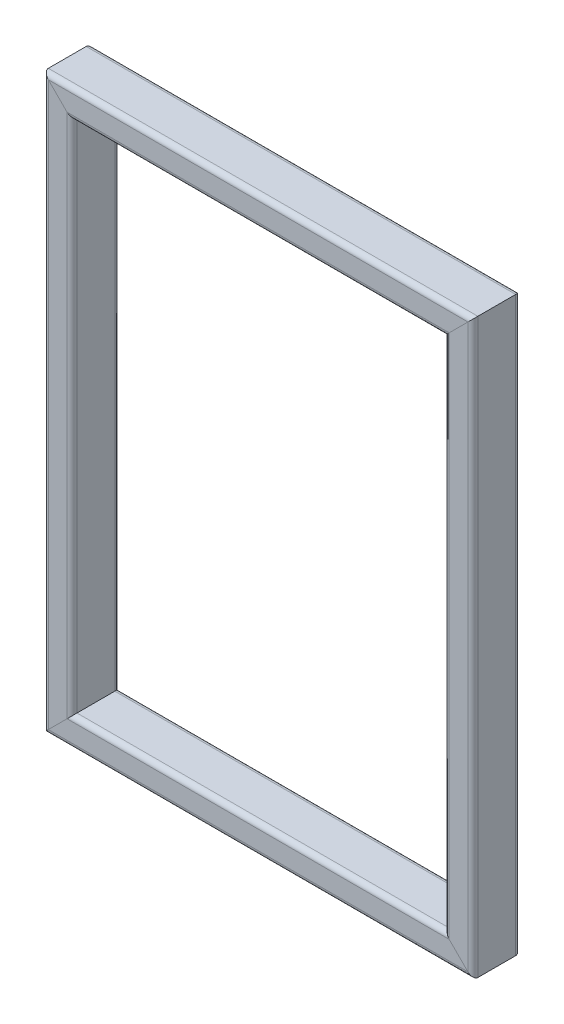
ISO-10303-21;
HEADER;
FILE_DESCRIPTION(('STEP AP214'),'2;1');
FILE_NAME('part.step','',(''),(''),'','','');
FILE_SCHEMA(('AUTOMOTIVE_DESIGN { 1 0 10303 214 1 1 1 1 }'));
ENDSEC;
DATA;
#1=APPLICATION_CONTEXT('core data for automotive mechanical design processes');
#2=APPLICATION_PROTOCOL_DEFINITION('international standard','automotive_design',2000,#1);
#3=PRODUCT_CONTEXT('',#1,'mechanical');
#4=PRODUCT('Part','Part','',(#3));
#5=PRODUCT_RELATED_PRODUCT_CATEGORY('part','',(#4));
#6=PRODUCT_DEFINITION_FORMATION('','',#4);
#7=PRODUCT_DEFINITION_CONTEXT('part definition',#1,'design');
#8=PRODUCT_DEFINITION('design','',#6,#7);
#9=PRODUCT_DEFINITION_SHAPE('','',#8);
#10=(LENGTH_UNIT() NAMED_UNIT(*) SI_UNIT(.MILLI.,.METRE.));
#11=(NAMED_UNIT(*) PLANE_ANGLE_UNIT() SI_UNIT($,.RADIAN.));
#12=(NAMED_UNIT(*) SI_UNIT($,.STERADIAN.) SOLID_ANGLE_UNIT());
#13=UNCERTAINTY_MEASURE_WITH_UNIT(LENGTH_MEASURE(1.E-05),#10,'distance_accuracy_value','');
#14=(GEOMETRIC_REPRESENTATION_CONTEXT(3) GLOBAL_UNCERTAINTY_ASSIGNED_CONTEXT((#13)) GLOBAL_UNIT_ASSIGNED_CONTEXT((#10,
#11,#12)) REPRESENTATION_CONTEXT('',''));
#15=CARTESIAN_POINT('',(0.,0.,0.));
#16=DIRECTION('',(0.,0.,1.));
#17=DIRECTION('',(1.,0.,0.));
#18=AXIS2_PLACEMENT_3D('',#15,#16,#17);
#19=CARTESIAN_POINT('',(-444.8,600.,-5.2));
#20=DIRECTION('',(0.,-1.,0.));
#21=DIRECTION('',(0.,0.,-1.));
#22=AXIS2_PLACEMENT_3D('',#19,#20,#21);
#23=CYLINDRICAL_SURFACE('',#22,5.20000000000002);
#24=CARTESIAN_POINT('',(-444.8,5.20000000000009,-5.2));
#25=DIRECTION('',(0.707106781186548,-0.707106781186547,0.));
#26=DIRECTION('',(-0.707106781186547,-0.707106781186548,0.));
#27=AXIS2_PLACEMENT_3D('',#24,#25,#26);
#28=ELLIPSE('',#27,7.35391052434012,5.20000000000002);
#29=CARTESIAN_POINT('',(-444.8,5.20000000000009,0.));
#30=VERTEX_POINT('',#29);
#31=CARTESIAN_POINT('',(-450.,0.,-5.2));
#32=VERTEX_POINT('',#31);
#33=EDGE_CURVE('E216',#30,#32,#28,.T.);
#34=ORIENTED_EDGE('',*,*,#33,.F.);
#35=DIRECTION('',(0.,-1.,0.));
#36=VECTOR('',#35,1.);
#37=CARTESIAN_POINT('',(-444.8,600.,0.));
#38=LINE('',#37,#36);
#39=CARTESIAN_POINT('',(-444.8,594.8,0.));
#40=VERTEX_POINT('',#39);
#41=EDGE_CURVE('E296',#40,#30,#38,.T.);
#42=ORIENTED_EDGE('',*,*,#41,.F.);
#43=CARTESIAN_POINT('',(-444.8,594.8,-5.2));
#44=DIRECTION('',(0.707106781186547,0.707106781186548,0.));
#45=DIRECTION('',(0.707106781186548,-0.707106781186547,0.));
#46=AXIS2_PLACEMENT_3D('',#43,#44,#45);
#47=ELLIPSE('',#46,7.35391052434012,5.20000000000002);
#48=CARTESIAN_POINT('',(-450.,600.,-5.2));
#49=VERTEX_POINT('',#48);
#50=EDGE_CURVE('E207',#49,#40,#47,.T.);
#51=ORIENTED_EDGE('',*,*,#50,.F.);
#52=DIRECTION('',(0.,-1.,0.));
#53=VECTOR('',#52,1.);
#54=CARTESIAN_POINT('',(-450.,600.,-5.2));
#55=LINE('',#54,#53);
#56=EDGE_CURVE('E76',#49,#32,#55,.T.);
#57=ORIENTED_EDGE('',*,*,#56,.T.);
#58=EDGE_LOOP('',(#34,#42,#51,#57));
#59=FACE_BOUND('',#58,.T.);
#60=ADVANCED_FACE('F72',(#59),#23,.T.);
#61=CARTESIAN_POINT('',(-444.8,600.,0.));
#62=DIRECTION('',(0.,0.,-1.));
#63=DIRECTION('',(-1.,0.,0.));
#64=AXIS2_PLACEMENT_3D('',#61,#62,#63);
#65=PLANE('',#64);
#66=DIRECTION('',(-0.707106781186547,-0.707106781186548,0.));
#67=VECTOR('',#66,1.);
#68=CARTESIAN_POINT('',(-147.4,302.6,0.));
#69=LINE('',#68,#67);
#70=CARTESIAN_POINT('',(-425.2,24.7999999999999,0.));
#71=VERTEX_POINT('',#70);
#72=EDGE_CURVE('E213',#71,#30,#69,.T.);
#73=ORIENTED_EDGE('',*,*,#72,.F.);
#74=DIRECTION('',(0.,-1.,0.));
#75=VECTOR('',#74,1.);
#76=CARTESIAN_POINT('',(-425.2,600.,0.));
#77=LINE('',#76,#75);
#78=CARTESIAN_POINT('',(-425.2,575.2,0.));
#79=VERTEX_POINT('',#78);
#80=EDGE_CURVE('E294',#79,#71,#77,.T.);
#81=ORIENTED_EDGE('',*,*,#80,.F.);
#82=DIRECTION('',(0.707106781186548,-0.707106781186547,0.));
#83=VECTOR('',#82,1.);
#84=CARTESIAN_POINT('',(-447.4,597.4,0.));
#85=LINE('',#84,#83);
#86=EDGE_CURVE('E312',#40,#79,#85,.T.);
#87=ORIENTED_EDGE('',*,*,#86,.F.);
#88=ORIENTED_EDGE('',*,*,#41,.T.);
#89=EDGE_LOOP('',(#73,#81,#87,#88));
#90=FACE_BOUND('',#89,.T.);
#91=ADVANCED_FACE('F303',(#90),#65,.F.);
#92=CARTESIAN_POINT('',(-425.2,600.,-5.2));
#93=DIRECTION('',(0.,-1.,0.));
#94=DIRECTION('',(0.,0.,-1.));
#95=AXIS2_PLACEMENT_3D('',#92,#93,#94);
#96=CYLINDRICAL_SURFACE('',#95,5.20000000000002);
#97=CARTESIAN_POINT('',(-425.2,24.7999999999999,-5.2));
#98=DIRECTION('',(0.707106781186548,-0.707106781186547,0.));
#99=DIRECTION('',(-0.707106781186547,-0.707106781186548,0.));
#100=AXIS2_PLACEMENT_3D('',#97,#98,#99);
#101=ELLIPSE('',#100,7.35391052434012,5.20000000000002);
#102=CARTESIAN_POINT('',(-420.,30.,-5.2));
#103=VERTEX_POINT('',#102);
#104=EDGE_CURVE('E13',#103,#71,#101,.T.);
#105=ORIENTED_EDGE('',*,*,#104,.F.);
#106=DIRECTION('',(0.,-1.,0.));
#107=VECTOR('',#106,1.);
#108=CARTESIAN_POINT('',(-420.,600.,-5.2));
#109=LINE('',#108,#107);
#110=CARTESIAN_POINT('',(-420.,570.,-5.2));
#111=VERTEX_POINT('',#110);
#112=EDGE_CURVE('E291',#111,#103,#109,.T.);
#113=ORIENTED_EDGE('',*,*,#112,.F.);
#114=CARTESIAN_POINT('',(-425.2,575.2,-5.2));
#115=DIRECTION('',(0.707106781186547,0.707106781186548,0.));
#116=DIRECTION('',(0.707106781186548,-0.707106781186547,0.));
#117=AXIS2_PLACEMENT_3D('',#114,#115,#116);
#118=ELLIPSE('',#117,7.35391052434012,5.20000000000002);
#119=EDGE_CURVE('E309',#79,#111,#118,.T.);
#120=ORIENTED_EDGE('',*,*,#119,.F.);
#121=ORIENTED_EDGE('',*,*,#80,.T.);
#122=EDGE_LOOP('',(#105,#113,#120,#121));
#123=FACE_BOUND('',#122,.T.);
#124=ADVANCED_FACE('F306',(#123),#96,.T.);
#125=CARTESIAN_POINT('',(-420.,600.,-44.8));
#126=DIRECTION('',(-1.,0.,0.));
#127=DIRECTION('',(0.,0.,1.));
#128=AXIS2_PLACEMENT_3D('',#125,#126,#127);
#129=PLANE('',#128);
#130=DIRECTION('',(0.,0.,1.));
#131=VECTOR('',#130,1.);
#132=CARTESIAN_POINT('',(-420.,30.,-44.8));
#133=LINE('',#132,#131);
#134=CARTESIAN_POINT('',(-420.,30.,-44.8));
#135=VERTEX_POINT('',#134);
#136=EDGE_CURVE('E82',#135,#103,#133,.T.);
#137=ORIENTED_EDGE('',*,*,#136,.F.);
#138=DIRECTION('',(0.,-1.,0.));
#139=VECTOR('',#138,1.);
#140=CARTESIAN_POINT('',(-420.,600.,-44.8));
#141=LINE('',#140,#139);
#142=CARTESIAN_POINT('',(-420.,570.,-44.8));
#143=VERTEX_POINT('',#142);
#144=EDGE_CURVE('E288',#143,#135,#141,.T.);
#145=ORIENTED_EDGE('',*,*,#144,.F.);
#146=DIRECTION('',(0.,0.,-1.));
#147=VECTOR('',#146,1.);
#148=CARTESIAN_POINT('',(-420.,570.,-44.8));
#149=LINE('',#148,#147);
#150=EDGE_CURVE('E311',#111,#143,#149,.T.);
#151=ORIENTED_EDGE('',*,*,#150,.F.);
#152=ORIENTED_EDGE('',*,*,#112,.T.);
#153=EDGE_LOOP('',(#137,#145,#151,#152));
#154=FACE_BOUND('',#153,.T.);
#155=ADVANCED_FACE('F322',(#154),#129,.F.);
#156=CARTESIAN_POINT('',(-425.2,600.,-44.8));
#157=DIRECTION('',(0.,-1.,0.));
#158=DIRECTION('',(0.,0.,-1.));
#159=AXIS2_PLACEMENT_3D('',#156,#157,#158);
#160=CYLINDRICAL_SURFACE('',#159,5.20000000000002);
#161=CARTESIAN_POINT('',(-425.2,24.7999999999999,-44.8));
#162=DIRECTION('',(0.707106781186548,-0.707106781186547,0.));
#163=DIRECTION('',(-0.707106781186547,-0.707106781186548,0.));
#164=AXIS2_PLACEMENT_3D('',#161,#162,#163);
#165=ELLIPSE('',#164,7.35391052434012,5.20000000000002);
#166=CARTESIAN_POINT('',(-425.2,24.8,-50.));
#167=VERTEX_POINT('',#166);
#168=EDGE_CURVE('E231',#167,#135,#165,.T.);
#169=ORIENTED_EDGE('',*,*,#168,.F.);
#170=DIRECTION('',(0.,-1.,0.));
#171=VECTOR('',#170,1.);
#172=CARTESIAN_POINT('',(-425.2,600.,-50.));
#173=LINE('',#172,#171);
#174=CARTESIAN_POINT('',(-425.2,575.2,-50.));
#175=VERTEX_POINT('',#174);
#176=EDGE_CURVE('E285',#175,#167,#173,.T.);
#177=ORIENTED_EDGE('',*,*,#176,.F.);
#178=CARTESIAN_POINT('',(-425.2,575.2,-44.8));
#179=DIRECTION('',(0.707106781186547,0.707106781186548,0.));
#180=DIRECTION('',(0.707106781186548,-0.707106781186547,0.));
#181=AXIS2_PLACEMENT_3D('',#178,#179,#180);
#182=ELLIPSE('',#181,7.35391052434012,5.20000000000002);
#183=EDGE_CURVE('E218',#143,#175,#182,.T.);
#184=ORIENTED_EDGE('',*,*,#183,.F.);
#185=ORIENTED_EDGE('',*,*,#144,.T.);
#186=EDGE_LOOP('',(#169,#177,#184,#185));
#187=FACE_BOUND('',#186,.T.);
#188=ADVANCED_FACE('F320',(#187),#160,.T.);
#189=CARTESIAN_POINT('',(-425.2,600.,-50.));
#190=DIRECTION('',(0.,0.,1.));
#191=DIRECTION('',(1.,0.,0.));
#192=AXIS2_PLACEMENT_3D('',#189,#190,#191);
#193=PLANE('',#192);
#194=DIRECTION('',(0.707106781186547,0.707106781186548,0.));
#195=VECTOR('',#194,1.);
#196=CARTESIAN_POINT('',(-137.6,312.4,-50.));
#197=LINE('',#196,#195);
#198=CARTESIAN_POINT('',(-444.8,5.20000000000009,-50.));
#199=VERTEX_POINT('',#198);
#200=EDGE_CURVE('E234',#199,#167,#197,.T.);
#201=ORIENTED_EDGE('',*,*,#200,.F.);
#202=DIRECTION('',(0.,-1.,0.));
#203=VECTOR('',#202,1.);
#204=CARTESIAN_POINT('',(-444.8,600.,-50.));
#205=LINE('',#204,#203);
#206=CARTESIAN_POINT('',(-444.8,594.8,-50.));
#207=VERTEX_POINT('',#206);
#208=EDGE_CURVE('E283',#207,#199,#205,.T.);
#209=ORIENTED_EDGE('',*,*,#208,.F.);
#210=DIRECTION('',(-0.707106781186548,0.707106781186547,0.));
#211=VECTOR('',#210,1.);
#212=CARTESIAN_POINT('',(-437.6,587.6,-50.));
#213=LINE('',#212,#211);
#214=EDGE_CURVE('E212',#175,#207,#213,.T.);
#215=ORIENTED_EDGE('',*,*,#214,.F.);
#216=ORIENTED_EDGE('',*,*,#176,.T.);
#217=EDGE_LOOP('',(#201,#209,#215,#216));
#218=FACE_BOUND('',#217,.T.);
#219=ADVANCED_FACE('F324',(#218),#193,.F.);
#220=CARTESIAN_POINT('',(-444.8,600.,-44.8));
#221=DIRECTION('',(0.,-1.,0.));
#222=DIRECTION('',(0.,0.,-1.));
#223=AXIS2_PLACEMENT_3D('',#220,#221,#222);
#224=CYLINDRICAL_SURFACE('',#223,5.20000000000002);
#225=CARTESIAN_POINT('',(-444.8,5.20000000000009,-44.8));
#226=DIRECTION('',(0.707106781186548,-0.707106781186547,0.));
#227=DIRECTION('',(-0.707106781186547,-0.707106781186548,0.));
#228=AXIS2_PLACEMENT_3D('',#225,#226,#227);
#229=ELLIPSE('',#228,7.35391052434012,5.20000000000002);
#230=CARTESIAN_POINT('',(-450.,0.,-44.8));
#231=VERTEX_POINT('',#230);
#232=EDGE_CURVE('E195',#231,#199,#229,.T.);
#233=ORIENTED_EDGE('',*,*,#232,.F.);
#234=DIRECTION('',(0.,-1.,0.));
#235=VECTOR('',#234,1.);
#236=CARTESIAN_POINT('',(-450.,600.,-44.8));
#237=LINE('',#236,#235);
#238=CARTESIAN_POINT('',(-450.,600.,-44.8));
#239=VERTEX_POINT('',#238);
#240=EDGE_CURVE('E187',#239,#231,#237,.T.);
#241=ORIENTED_EDGE('',*,*,#240,.F.);
#242=CARTESIAN_POINT('',(-444.8,594.8,-44.8));
#243=DIRECTION('',(0.707106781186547,0.707106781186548,0.));
#244=DIRECTION('',(0.707106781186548,-0.707106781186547,0.));
#245=AXIS2_PLACEMENT_3D('',#242,#243,#244);
#246=ELLIPSE('',#245,7.35391052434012,5.20000000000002);
#247=EDGE_CURVE('E192',#207,#239,#246,.T.);
#248=ORIENTED_EDGE('',*,*,#247,.F.);
#249=ORIENTED_EDGE('',*,*,#208,.T.);
#250=EDGE_LOOP('',(#233,#241,#248,#249));
#251=FACE_BOUND('',#250,.T.);
#252=ADVANCED_FACE('F189',(#251),#224,.T.);
#253=CARTESIAN_POINT('',(-425.2,600.,-5.2));
#254=DIRECTION('',(0.,-1.,0.));
#255=DIRECTION('',(0.,0.,-1.));
#256=AXIS2_PLACEMENT_3D('',#253,#254,#255);
#257=CYLINDRICAL_SURFACE('',#256,2.60000000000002);
#258=DIRECTION('',(0.,-1.,0.));
#259=VECTOR('',#258,1.);
#260=CARTESIAN_POINT('',(-422.6,600.,-5.2));
#261=LINE('',#260,#259);
#262=CARTESIAN_POINT('',(-422.6,572.6,-5.2));
#263=VERTEX_POINT('',#262);
#264=CARTESIAN_POINT('',(-422.6,27.4000000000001,-5.2));
#265=VERTEX_POINT('',#264);
#266=EDGE_CURVE('E240',#263,#265,#261,.T.);
#267=ORIENTED_EDGE('',*,*,#266,.T.);
#268=CARTESIAN_POINT('',(-425.2,24.7999999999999,-5.2));
#269=DIRECTION('',(0.707106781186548,-0.707106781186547,0.));
#270=DIRECTION('',(-0.707106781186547,-0.707106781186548,0.));
#271=AXIS2_PLACEMENT_3D('',#268,#269,#270);
#272=ELLIPSE('',#271,3.67695526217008,2.60000000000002);
#273=CARTESIAN_POINT('',(-425.2,24.8,-2.6));
#274=VERTEX_POINT('',#273);
#275=EDGE_CURVE('E118',#265,#274,#272,.T.);
#276=ORIENTED_EDGE('',*,*,#275,.T.);
#277=DIRECTION('',(0.,-1.,0.));
#278=VECTOR('',#277,1.);
#279=CARTESIAN_POINT('',(-425.2,600.,-2.6));
#280=LINE('',#279,#278);
#281=CARTESIAN_POINT('',(-425.2,575.2,-2.6));
#282=VERTEX_POINT('',#281);
#283=EDGE_CURVE('E243',#282,#274,#280,.T.);
#284=ORIENTED_EDGE('',*,*,#283,.F.);
#285=CARTESIAN_POINT('',(-425.2,575.2,-5.2));
#286=DIRECTION('',(0.707106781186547,0.707106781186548,0.));
#287=DIRECTION('',(0.707106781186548,-0.707106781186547,0.));
#288=AXIS2_PLACEMENT_3D('',#285,#286,#287);
#289=ELLIPSE('',#288,3.67695526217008,2.60000000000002);
#290=EDGE_CURVE('E239',#282,#263,#289,.T.);
#291=ORIENTED_EDGE('',*,*,#290,.T.);
#292=EDGE_LOOP('',(#267,#276,#284,#291));
#293=FACE_BOUND('',#292,.T.);
#294=ADVANCED_FACE('F331',(#293),#257,.F.);
#295=CARTESIAN_POINT('',(-444.8,600.,-2.6));
#296=DIRECTION('',(0.,0.,-1.));
#297=DIRECTION('',(-1.,0.,0.));
#298=AXIS2_PLACEMENT_3D('',#295,#296,#297);
#299=PLANE('',#298);
#300=ORIENTED_EDGE('',*,*,#283,.T.);
#301=DIRECTION('',(-0.707106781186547,-0.707106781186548,0.));
#302=VECTOR('',#301,1.);
#303=CARTESIAN_POINT('',(-147.4,302.6,-2.6));
#304=LINE('',#303,#302);
#305=CARTESIAN_POINT('',(-444.8,5.20000000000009,-2.6));
#306=VERTEX_POINT('',#305);
#307=EDGE_CURVE('E91',#274,#306,#304,.T.);
#308=ORIENTED_EDGE('',*,*,#307,.T.);
#309=DIRECTION('',(0.,-1.,0.));
#310=VECTOR('',#309,1.);
#311=CARTESIAN_POINT('',(-444.8,600.,-2.6));
#312=LINE('',#311,#310);
#313=CARTESIAN_POINT('',(-444.8,594.8,-2.6));
#314=VERTEX_POINT('',#313);
#315=EDGE_CURVE('E248',#314,#306,#312,.T.);
#316=ORIENTED_EDGE('',*,*,#315,.F.);
#317=DIRECTION('',(0.707106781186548,-0.707106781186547,0.));
#318=VECTOR('',#317,1.);
#319=CARTESIAN_POINT('',(-447.4,597.4,-2.6));
#320=LINE('',#319,#318);
#321=EDGE_CURVE('E242',#314,#282,#320,.T.);
#322=ORIENTED_EDGE('',*,*,#321,.T.);
#323=EDGE_LOOP('',(#300,#308,#316,#322));
#324=FACE_BOUND('',#323,.T.);
#325=ADVANCED_FACE('F373',(#324),#299,.T.);
#326=CARTESIAN_POINT('',(-444.8,600.,-5.2));
#327=DIRECTION('',(0.,-1.,0.));
#328=DIRECTION('',(0.,0.,-1.));
#329=AXIS2_PLACEMENT_3D('',#326,#327,#328);
#330=CYLINDRICAL_SURFACE('',#329,2.60000000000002);
#331=ORIENTED_EDGE('',*,*,#315,.T.);
#332=CARTESIAN_POINT('',(-444.8,5.20000000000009,-5.2));
#333=DIRECTION('',(0.707106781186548,-0.707106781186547,0.));
#334=DIRECTION('',(-0.707106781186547,-0.707106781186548,0.));
#335=AXIS2_PLACEMENT_3D('',#332,#333,#334);
#336=ELLIPSE('',#335,3.67695526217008,2.60000000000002);
#337=CARTESIAN_POINT('',(-447.4,2.60000000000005,-5.2));
#338=VERTEX_POINT('',#337);
#339=EDGE_CURVE('E244',#306,#338,#336,.T.);
#340=ORIENTED_EDGE('',*,*,#339,.T.);
#341=DIRECTION('',(0.,-1.,0.));
#342=VECTOR('',#341,1.);
#343=CARTESIAN_POINT('',(-447.4,600.,-5.2));
#344=LINE('',#343,#342);
#345=CARTESIAN_POINT('',(-447.4,597.4,-5.2));
#346=VERTEX_POINT('',#345);
#347=EDGE_CURVE('E253',#346,#338,#344,.T.);
#348=ORIENTED_EDGE('',*,*,#347,.F.);
#349=CARTESIAN_POINT('',(-444.8,594.8,-5.2));
#350=DIRECTION('',(0.707106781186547,0.707106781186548,0.));
#351=DIRECTION('',(0.707106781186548,-0.707106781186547,0.));
#352=AXIS2_PLACEMENT_3D('',#349,#350,#351);
#353=ELLIPSE('',#352,3.67695526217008,2.60000000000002);
#354=EDGE_CURVE('E247',#346,#314,#353,.T.);
#355=ORIENTED_EDGE('',*,*,#354,.T.);
#356=EDGE_LOOP('',(#331,#340,#348,#355));
#357=FACE_BOUND('',#356,.T.);
#358=ADVANCED_FACE('F384',(#357),#330,.F.);
#359=CARTESIAN_POINT('',(-447.4,600.,-5.2));
#360=DIRECTION('',(1.,0.,0.));
#361=DIRECTION('',(0.,0.,-1.));
#362=AXIS2_PLACEMENT_3D('',#359,#360,#361);
#363=PLANE('',#362);
#364=ORIENTED_EDGE('',*,*,#347,.T.);
#365=DIRECTION('',(0.,0.,-1.));
#366=VECTOR('',#365,1.);
#367=CARTESIAN_POINT('',(-447.4,2.60000000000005,-5.2));
#368=LINE('',#367,#366);
#369=CARTESIAN_POINT('',(-447.4,2.60000000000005,-44.8));
#370=VERTEX_POINT('',#369);
#371=EDGE_CURVE('E249',#338,#370,#368,.T.);
#372=ORIENTED_EDGE('',*,*,#371,.T.);
#373=DIRECTION('',(0.,-1.,0.));
#374=VECTOR('',#373,1.);
#375=CARTESIAN_POINT('',(-447.4,600.,-44.8));
#376=LINE('',#375,#374);
#377=CARTESIAN_POINT('',(-447.4,597.4,-44.8));
#378=VERTEX_POINT('',#377);
#379=EDGE_CURVE('E258',#378,#370,#376,.T.);
#380=ORIENTED_EDGE('',*,*,#379,.F.);
#381=DIRECTION('',(0.,0.,1.));
#382=VECTOR('',#381,1.);
#383=CARTESIAN_POINT('',(-447.4,597.4,-5.2));
#384=LINE('',#383,#382);
#385=EDGE_CURVE('E252',#378,#346,#384,.T.);
#386=ORIENTED_EDGE('',*,*,#385,.T.);
#387=EDGE_LOOP('',(#364,#372,#380,#386));
#388=FACE_BOUND('',#387,.T.);
#389=ADVANCED_FACE('F395',(#388),#363,.T.);
#390=CARTESIAN_POINT('',(-444.8,600.,-44.8));
#391=DIRECTION('',(0.,-1.,0.));
#392=DIRECTION('',(0.,0.,-1.));
#393=AXIS2_PLACEMENT_3D('',#390,#391,#392);
#394=CYLINDRICAL_SURFACE('',#393,2.60000000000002);
#395=ORIENTED_EDGE('',*,*,#379,.T.);
#396=CARTESIAN_POINT('',(-444.8,5.20000000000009,-44.8));
#397=DIRECTION('',(0.707106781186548,-0.707106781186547,0.));
#398=DIRECTION('',(-0.707106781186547,-0.707106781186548,0.));
#399=AXIS2_PLACEMENT_3D('',#396,#397,#398);
#400=ELLIPSE('',#399,3.67695526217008,2.60000000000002);
#401=CARTESIAN_POINT('',(-444.8,5.20000000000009,-47.4));
#402=VERTEX_POINT('',#401);
#403=EDGE_CURVE('E254',#370,#402,#400,.T.);
#404=ORIENTED_EDGE('',*,*,#403,.T.);
#405=DIRECTION('',(0.,-1.,0.));
#406=VECTOR('',#405,1.);
#407=CARTESIAN_POINT('',(-444.8,600.,-47.4));
#408=LINE('',#407,#406);
#409=CARTESIAN_POINT('',(-444.8,594.8,-47.4));
#410=VERTEX_POINT('',#409);
#411=EDGE_CURVE('E263',#410,#402,#408,.T.);
#412=ORIENTED_EDGE('',*,*,#411,.F.);
#413=CARTESIAN_POINT('',(-444.8,594.8,-44.8));
#414=DIRECTION('',(0.707106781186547,0.707106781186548,0.));
#415=DIRECTION('',(0.707106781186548,-0.707106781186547,0.));
#416=AXIS2_PLACEMENT_3D('',#413,#414,#415);
#417=ELLIPSE('',#416,3.67695526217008,2.60000000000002);
#418=EDGE_CURVE('E257',#410,#378,#417,.T.);
#419=ORIENTED_EDGE('',*,*,#418,.T.);
#420=EDGE_LOOP('',(#395,#404,#412,#419));
#421=FACE_BOUND('',#420,.T.);
#422=ADVANCED_FACE('F406',(#421),#394,.F.);
#423=CARTESIAN_POINT('',(-425.2,600.,-47.4));
#424=DIRECTION('',(0.,0.,1.));
#425=DIRECTION('',(1.,0.,0.));
#426=AXIS2_PLACEMENT_3D('',#423,#424,#425);
#427=PLANE('',#426);
#428=ORIENTED_EDGE('',*,*,#411,.T.);
#429=DIRECTION('',(0.707106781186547,0.707106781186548,0.));
#430=VECTOR('',#429,1.);
#431=CARTESIAN_POINT('',(-137.6,312.4,-47.4));
#432=LINE('',#431,#430);
#433=CARTESIAN_POINT('',(-425.2,24.7999999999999,-47.4));
#434=VERTEX_POINT('',#433);
#435=EDGE_CURVE('E259',#402,#434,#432,.T.);
#436=ORIENTED_EDGE('',*,*,#435,.T.);
#437=DIRECTION('',(0.,-1.,0.));
#438=VECTOR('',#437,1.);
#439=CARTESIAN_POINT('',(-425.2,600.,-47.4));
#440=LINE('',#439,#438);
#441=CARTESIAN_POINT('',(-425.2,575.2,-47.4));
#442=VERTEX_POINT('',#441);
#443=EDGE_CURVE('E267',#442,#434,#440,.T.);
#444=ORIENTED_EDGE('',*,*,#443,.F.);
#445=DIRECTION('',(-0.707106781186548,0.707106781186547,0.));
#446=VECTOR('',#445,1.);
#447=CARTESIAN_POINT('',(-437.6,587.6,-47.4));
#448=LINE('',#447,#446);
#449=EDGE_CURVE('E262',#442,#410,#448,.T.);
#450=ORIENTED_EDGE('',*,*,#449,.T.);
#451=EDGE_LOOP('',(#428,#436,#444,#450));
#452=FACE_BOUND('',#451,.T.);
#453=ADVANCED_FACE('F417',(#452),#427,.T.);
#454=CARTESIAN_POINT('',(-425.2,600.,-44.8));
#455=DIRECTION('',(0.,-1.,0.));
#456=DIRECTION('',(0.,0.,-1.));
#457=AXIS2_PLACEMENT_3D('',#454,#455,#456);
#458=CYLINDRICAL_SURFACE('',#457,2.60000000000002);
#459=ORIENTED_EDGE('',*,*,#443,.T.);
#460=CARTESIAN_POINT('',(-425.2,24.7999999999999,-44.8));
#461=DIRECTION('',(0.707106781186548,-0.707106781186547,0.));
#462=DIRECTION('',(-0.707106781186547,-0.707106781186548,0.));
#463=AXIS2_PLACEMENT_3D('',#460,#461,#462);
#464=ELLIPSE('',#463,3.67695526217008,2.60000000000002);
#465=CARTESIAN_POINT('',(-422.6,27.4000000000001,-44.8));
#466=VERTEX_POINT('',#465);
#467=EDGE_CURVE('E264',#434,#466,#464,.T.);
#468=ORIENTED_EDGE('',*,*,#467,.T.);
#469=DIRECTION('',(0.,-1.,0.));
#470=VECTOR('',#469,1.);
#471=CARTESIAN_POINT('',(-422.6,600.,-44.8));
#472=LINE('',#471,#470);
#473=CARTESIAN_POINT('',(-422.6,572.6,-44.8));
#474=VERTEX_POINT('',#473);
#475=EDGE_CURVE('E225',#474,#466,#472,.T.);
#476=ORIENTED_EDGE('',*,*,#475,.F.);
#477=CARTESIAN_POINT('',(-425.2,575.2,-44.8));
#478=DIRECTION('',(0.707106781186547,0.707106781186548,0.));
#479=DIRECTION('',(0.707106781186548,-0.707106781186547,0.));
#480=AXIS2_PLACEMENT_3D('',#477,#478,#479);
#481=ELLIPSE('',#480,3.67695526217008,2.60000000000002);
#482=EDGE_CURVE('E266',#474,#442,#481,.T.);
#483=ORIENTED_EDGE('',*,*,#482,.T.);
#484=EDGE_LOOP('',(#459,#468,#476,#483));
#485=FACE_BOUND('',#484,.T.);
#486=ADVANCED_FACE('F428',(#485),#458,.F.);
#487=CARTESIAN_POINT('',(-422.6,600.,-44.8));
#488=DIRECTION('',(-1.,0.,0.));
#489=DIRECTION('',(0.,0.,1.));
#490=AXIS2_PLACEMENT_3D('',#487,#488,#489);
#491=PLANE('',#490);
#492=ORIENTED_EDGE('',*,*,#475,.T.);
#493=DIRECTION('',(0.,0.,1.));
#494=VECTOR('',#493,1.);
#495=CARTESIAN_POINT('',(-422.6,27.4000000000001,-44.8));
#496=LINE('',#495,#494);
#497=EDGE_CURVE('E113',#466,#265,#496,.T.);
#498=ORIENTED_EDGE('',*,*,#497,.T.);
#499=ORIENTED_EDGE('',*,*,#266,.F.);
#500=DIRECTION('',(0.,0.,-1.));
#501=VECTOR('',#500,1.);
#502=CARTESIAN_POINT('',(-422.6,572.6,-44.8));
#503=LINE('',#502,#501);
#504=EDGE_CURVE('E200',#263,#474,#503,.T.);
#505=ORIENTED_EDGE('',*,*,#504,.T.);
#506=EDGE_LOOP('',(#492,#498,#499,#505));
#507=FACE_BOUND('',#506,.T.);
#508=ADVANCED_FACE('F439',(#507),#491,.T.);
#509=CARTESIAN_POINT('',(-450.,600.,-5.2));
#510=DIRECTION('',(1.,0.,0.));
#511=DIRECTION('',(0.,0.,-1.));
#512=AXIS2_PLACEMENT_3D('',#509,#510,#511);
#513=PLANE('',#512);
#514=DIRECTION('',(0.,0.,-1.));
#515=VECTOR('',#514,1.);
#516=CARTESIAN_POINT('',(-450.,0.,-5.2));
#517=LINE('',#516,#515);
#518=EDGE_CURVE('E227',#32,#231,#517,.T.);
#519=ORIENTED_EDGE('',*,*,#518,.F.);
#520=ORIENTED_EDGE('',*,*,#56,.F.);
#521=DIRECTION('',(0.,0.,1.));
#522=VECTOR('',#521,1.);
#523=CARTESIAN_POINT('',(-450.,600.,-5.2));
#524=LINE('',#523,#522);
#525=EDGE_CURVE('E199',#239,#49,#524,.T.);
#526=ORIENTED_EDGE('',*,*,#525,.F.);
#527=ORIENTED_EDGE('',*,*,#240,.T.);
#528=EDGE_LOOP('',(#519,#520,#526,#527));
#529=FACE_BOUND('',#528,.T.);
#530=ADVANCED_FACE('F203',(#529),#513,.F.);
#531=CARTESIAN_POINT('',(-450.,600.,0.));
#532=DIRECTION('',(0.707106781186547,0.707106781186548,0.));
#533=DIRECTION('',(-0.707106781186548,0.707106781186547,0.));
#534=AXIS2_PLACEMENT_3D('',#531,#532,#533);
#535=PLANE('',#534);
#536=ORIENTED_EDGE('',*,*,#290,.F.);
#537=ORIENTED_EDGE('',*,*,#321,.F.);
#538=ORIENTED_EDGE('',*,*,#354,.F.);
#539=ORIENTED_EDGE('',*,*,#385,.F.);
#540=ORIENTED_EDGE('',*,*,#418,.F.);
#541=ORIENTED_EDGE('',*,*,#449,.F.);
#542=ORIENTED_EDGE('',*,*,#482,.F.);
#543=ORIENTED_EDGE('',*,*,#504,.F.);
#544=EDGE_LOOP('',(#536,#537,#538,#539,#540,#541,#542,#543));
#545=FACE_BOUND('',#544,.T.);
#546=ORIENTED_EDGE('',*,*,#525,.T.);
#547=ORIENTED_EDGE('',*,*,#50,.T.);
#548=ORIENTED_EDGE('',*,*,#86,.T.);
#549=ORIENTED_EDGE('',*,*,#119,.T.);
#550=ORIENTED_EDGE('',*,*,#150,.T.);
#551=ORIENTED_EDGE('',*,*,#183,.T.);
#552=ORIENTED_EDGE('',*,*,#214,.T.);
#553=ORIENTED_EDGE('',*,*,#247,.T.);
#554=EDGE_LOOP('',(#546,#547,#548,#549,#550,#551,#552,#553));
#555=FACE_BOUND('',#554,.T.);
#556=ADVANCED_FACE('F210',(#545,#555),#535,.T.);
#557=CARTESIAN_POINT('',(-450.,0.,0.));
#558=DIRECTION('',(0.707106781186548,-0.707106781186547,0.));
#559=DIRECTION('',(0.707106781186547,0.707106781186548,0.));
#560=AXIS2_PLACEMENT_3D('',#557,#558,#559);
#561=PLANE('',#560);
#562=ORIENTED_EDGE('',*,*,#275,.F.);
#563=ORIENTED_EDGE('',*,*,#497,.F.);
#564=ORIENTED_EDGE('',*,*,#467,.F.);
#565=ORIENTED_EDGE('',*,*,#435,.F.);
#566=ORIENTED_EDGE('',*,*,#403,.F.);
#567=ORIENTED_EDGE('',*,*,#371,.F.);
#568=ORIENTED_EDGE('',*,*,#339,.F.);
#569=ORIENTED_EDGE('',*,*,#307,.F.);
#570=EDGE_LOOP('',(#562,#563,#564,#565,#566,#567,#568,#569));
#571=FACE_BOUND('',#570,.T.);
#572=ORIENTED_EDGE('',*,*,#72,.T.);
#573=ORIENTED_EDGE('',*,*,#33,.T.);
#574=ORIENTED_EDGE('',*,*,#518,.T.);
#575=ORIENTED_EDGE('',*,*,#232,.T.);
#576=ORIENTED_EDGE('',*,*,#200,.T.);
#577=ORIENTED_EDGE('',*,*,#168,.T.);
#578=ORIENTED_EDGE('',*,*,#136,.T.);
#579=ORIENTED_EDGE('',*,*,#104,.T.);
#580=EDGE_LOOP('',(#572,#573,#574,#575,#576,#577,#578,#579));
#581=FACE_BOUND('',#580,.T.);
#582=ADVANCED_FACE('F74',(#571,#581),#561,.T.);
#583=CLOSED_SHELL('',(#60,#91,#124,#155,#188,#219,#252,#294,#325,#358,#389,#422,#453,#486,#508,
#530,#556,#582));
#584=MANIFOLD_SOLID_BREP('B2',#583);
#585=CARTESIAN_POINT('',(-450.,5.20000000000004,-5.2));
#586=DIRECTION('',(1.,0.,0.));
#587=DIRECTION('',(0.,1.,0.));
#588=AXIS2_PLACEMENT_3D('',#585,#586,#587);
#589=CYLINDRICAL_SURFACE('',#588,5.20000000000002);
#590=CARTESIAN_POINT('',(-444.8,5.20000000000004,-5.2));
#591=DIRECTION('',(-0.707106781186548,0.707106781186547,0.));
#592=DIRECTION('',(0.707106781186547,0.707106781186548,0.));
#593=AXIS2_PLACEMENT_3D('',#590,#591,#592);
#594=ELLIPSE('',#593,7.35391052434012,5.20000000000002);
#595=CARTESIAN_POINT('',(-450.,0.,-5.2));
#596=VERTEX_POINT('',#595);
#597=CARTESIAN_POINT('',(-444.8,5.20000000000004,0.));
#598=VERTEX_POINT('',#597);
#599=EDGE_CURVE('E698',#596,#598,#594,.T.);
#600=ORIENTED_EDGE('',*,*,#599,.F.);
#601=DIRECTION('',(1.,0.,0.));
#602=VECTOR('',#601,1.);
#603=CARTESIAN_POINT('',(-450.,0.,-5.2));
#604=LINE('',#603,#602);
#605=CARTESIAN_POINT('',(0.,0.,-5.2));
#606=VERTEX_POINT('',#605);
#607=EDGE_CURVE('E574',#596,#606,#604,.T.);
#608=ORIENTED_EDGE('',*,*,#607,.T.);
#609=CARTESIAN_POINT('',(-5.20000000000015,5.20000000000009,-5.2));
#610=DIRECTION('',(0.707106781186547,0.707106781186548,0.));
#611=DIRECTION('',(0.707106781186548,-0.707106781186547,0.));
#612=AXIS2_PLACEMENT_3D('',#609,#610,#611);
#613=ELLIPSE('',#612,7.35391052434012,5.20000000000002);
#614=CARTESIAN_POINT('',(-5.20000000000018,5.20000000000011,0.));
#615=VERTEX_POINT('',#614);
#616=EDGE_CURVE('E779',#615,#606,#613,.T.);
#617=ORIENTED_EDGE('',*,*,#616,.F.);
#618=DIRECTION('',(1.,0.,0.));
#619=VECTOR('',#618,1.);
#620=CARTESIAN_POINT('',(-450.,5.20000000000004,0.));
#621=LINE('',#620,#619);
#622=EDGE_CURVE('E772',#598,#615,#621,.T.);
#623=ORIENTED_EDGE('',*,*,#622,.F.);
#624=EDGE_LOOP('',(#600,#608,#617,#623));
#625=FACE_BOUND('',#624,.T.);
#626=ADVANCED_FACE('F570',(#625),#589,.T.);
#627=CARTESIAN_POINT('',(-450.,5.20000000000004,0.));
#628=DIRECTION('',(0.,0.,-1.));
#629=DIRECTION('',(-1.,0.,0.));
#630=AXIS2_PLACEMENT_3D('',#627,#628,#629);
#631=PLANE('',#630);
#632=DIRECTION('',(0.707106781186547,0.707106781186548,0.));
#633=VECTOR('',#632,1.);
#634=CARTESIAN_POINT('',(-447.4,2.6000000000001,0.));
#635=LINE('',#634,#633);
#636=CARTESIAN_POINT('',(-425.2,24.8,0.));
#637=VERTEX_POINT('',#636);
#638=EDGE_CURVE('E716',#598,#637,#635,.T.);
#639=ORIENTED_EDGE('',*,*,#638,.F.);
#640=ORIENTED_EDGE('',*,*,#622,.T.);
#641=DIRECTION('',(0.707106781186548,-0.707106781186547,0.));
#642=VECTOR('',#641,1.);
#643=CARTESIAN_POINT('',(-227.6,227.6,0.));
#644=LINE('',#643,#642);
#645=CARTESIAN_POINT('',(-24.8,24.8,0.));
#646=VERTEX_POINT('',#645);
#647=EDGE_CURVE('E688',#646,#615,#644,.T.);
#648=ORIENTED_EDGE('',*,*,#647,.F.);
#649=DIRECTION('',(1.,0.,0.));
#650=VECTOR('',#649,1.);
#651=CARTESIAN_POINT('',(-450.,24.8,0.));
#652=LINE('',#651,#650);
#653=EDGE_CURVE('E771',#637,#646,#652,.T.);
#654=ORIENTED_EDGE('',*,*,#653,.F.);
#655=EDGE_LOOP('',(#639,#640,#648,#654));
#656=FACE_BOUND('',#655,.T.);
#657=ADVANCED_FACE('F826',(#656),#631,.F.);
#658=CARTESIAN_POINT('',(-450.,24.8,-5.2));
#659=DIRECTION('',(1.,0.,0.));
#660=DIRECTION('',(0.,1.,0.));
#661=AXIS2_PLACEMENT_3D('',#658,#659,#660);
#662=CYLINDRICAL_SURFACE('',#661,5.20000000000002);
#663=CARTESIAN_POINT('',(-425.2,24.8,-5.2));
#664=DIRECTION('',(-0.707106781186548,0.707106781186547,0.));
#665=DIRECTION('',(0.707106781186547,0.707106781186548,0.));
#666=AXIS2_PLACEMENT_3D('',#663,#664,#665);
#667=ELLIPSE('',#666,7.35391052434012,5.20000000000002);
#668=CARTESIAN_POINT('',(-420.,30.,-5.2));
#669=VERTEX_POINT('',#668);
#670=EDGE_CURVE('E713',#637,#669,#667,.T.);
#671=ORIENTED_EDGE('',*,*,#670,.F.);
#672=ORIENTED_EDGE('',*,*,#653,.T.);
#673=CARTESIAN_POINT('',(-24.8,24.8,-5.2));
#674=DIRECTION('',(0.707106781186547,0.707106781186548,0.));
#675=DIRECTION('',(0.707106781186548,-0.707106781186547,0.));
#676=AXIS2_PLACEMENT_3D('',#673,#674,#675);
#677=ELLIPSE('',#676,7.35391052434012,5.20000000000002);
#678=CARTESIAN_POINT('',(-30.0000000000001,30.0000000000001,-5.2));
#679=VERTEX_POINT('',#678);
#680=EDGE_CURVE('E699',#679,#646,#677,.T.);
#681=ORIENTED_EDGE('',*,*,#680,.F.);
#682=DIRECTION('',(1.,0.,0.));
#683=VECTOR('',#682,1.);
#684=CARTESIAN_POINT('',(-450.,30.,-5.2));
#685=LINE('',#684,#683);
#686=EDGE_CURVE('E769',#669,#679,#685,.T.);
#687=ORIENTED_EDGE('',*,*,#686,.F.);
#688=EDGE_LOOP('',(#671,#672,#681,#687));
#689=FACE_BOUND('',#688,.T.);
#690=ADVANCED_FACE('F824',(#689),#662,.T.);
#691=CARTESIAN_POINT('',(-450.,30.,-44.8));
#692=DIRECTION('',(0.,-1.,0.));
#693=DIRECTION('',(1.,0.,0.));
#694=AXIS2_PLACEMENT_3D('',#691,#692,#693);
#695=PLANE('',#694);
#696=DIRECTION('',(0.,0.,-1.));
#697=VECTOR('',#696,1.);
#698=CARTESIAN_POINT('',(-420.,30.,-44.8));
#699=LINE('',#698,#697);
#700=CARTESIAN_POINT('',(-420.,30.,-44.8));
#701=VERTEX_POINT('',#700);
#702=EDGE_CURVE('E708',#669,#701,#699,.T.);
#703=ORIENTED_EDGE('',*,*,#702,.F.);
#704=ORIENTED_EDGE('',*,*,#686,.T.);
#705=DIRECTION('',(0.,0.,1.));
#706=VECTOR('',#705,1.);
#707=CARTESIAN_POINT('',(-30.0000000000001,30.0000000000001,-44.8));
#708=LINE('',#707,#706);
#709=CARTESIAN_POINT('',(-30.0000000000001,30.0000000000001,-44.8));
#710=VERTEX_POINT('',#709);
#711=EDGE_CURVE('E818',#710,#679,#708,.T.);
#712=ORIENTED_EDGE('',*,*,#711,.F.);
#713=DIRECTION('',(1.,0.,0.));
#714=VECTOR('',#713,1.);
#715=CARTESIAN_POINT('',(-450.,30.,-44.8));
#716=LINE('',#715,#714);
#717=EDGE_CURVE('E767',#701,#710,#716,.T.);
#718=ORIENTED_EDGE('',*,*,#717,.F.);
#719=EDGE_LOOP('',(#703,#704,#712,#718));
#720=FACE_BOUND('',#719,.T.);
#721=ADVANCED_FACE('F833',(#720),#695,.F.);
#722=CARTESIAN_POINT('',(-450.,24.8,-44.8));
#723=DIRECTION('',(1.,0.,0.));
#724=DIRECTION('',(0.,1.,0.));
#725=AXIS2_PLACEMENT_3D('',#722,#723,#724);
#726=CYLINDRICAL_SURFACE('',#725,5.20000000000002);
#727=CARTESIAN_POINT('',(-425.2,24.8,-44.8));
#728=DIRECTION('',(-0.707106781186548,0.707106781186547,0.));
#729=DIRECTION('',(0.707106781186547,0.707106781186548,0.));
#730=AXIS2_PLACEMENT_3D('',#727,#728,#729);
#731=ELLIPSE('',#730,7.35391052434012,5.20000000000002);
#732=CARTESIAN_POINT('',(-425.2,24.8,-50.));
#733=VERTEX_POINT('',#732);
#734=EDGE_CURVE('E704',#701,#733,#731,.T.);
#735=ORIENTED_EDGE('',*,*,#734,.F.);
#736=ORIENTED_EDGE('',*,*,#717,.T.);
#737=CARTESIAN_POINT('',(-24.8,24.8,-44.8));
#738=DIRECTION('',(0.707106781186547,0.707106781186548,0.));
#739=DIRECTION('',(0.707106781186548,-0.707106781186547,0.));
#740=AXIS2_PLACEMENT_3D('',#737,#738,#739);
#741=ELLIPSE('',#740,7.35391052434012,5.20000000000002);
#742=CARTESIAN_POINT('',(-24.8000000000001,24.8000000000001,-50.));
#743=VERTEX_POINT('',#742);
#744=EDGE_CURVE('E815',#743,#710,#741,.T.);
#745=ORIENTED_EDGE('',*,*,#744,.F.);
#746=DIRECTION('',(1.,0.,0.));
#747=VECTOR('',#746,1.);
#748=CARTESIAN_POINT('',(-450.,24.8,-50.));
#749=LINE('',#748,#747);
#750=EDGE_CURVE('E765',#733,#743,#749,.T.);
#751=ORIENTED_EDGE('',*,*,#750,.F.);
#752=EDGE_LOOP('',(#735,#736,#745,#751));
#753=FACE_BOUND('',#752,.T.);
#754=ADVANCED_FACE('F838',(#753),#726,.T.);
#755=CARTESIAN_POINT('',(-450.,24.8,-50.));
#756=DIRECTION('',(0.,0.,1.));
#757=DIRECTION('',(1.,0.,0.));
#758=AXIS2_PLACEMENT_3D('',#755,#756,#757);
#759=PLANE('',#758);
#760=DIRECTION('',(-0.707106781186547,-0.707106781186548,0.));
#761=VECTOR('',#760,1.);
#762=CARTESIAN_POINT('',(-437.6,12.4000000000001,-50.));
#763=LINE('',#762,#761);
#764=CARTESIAN_POINT('',(-444.8,5.20000000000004,-50.));
#765=VERTEX_POINT('',#764);
#766=EDGE_CURVE('E580',#733,#765,#763,.T.);
#767=ORIENTED_EDGE('',*,*,#766,.F.);
#768=ORIENTED_EDGE('',*,*,#750,.T.);
#769=DIRECTION('',(-0.707106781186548,0.707106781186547,0.));
#770=VECTOR('',#769,1.);
#771=CARTESIAN_POINT('',(-237.4,237.4,-50.));
#772=LINE('',#771,#770);
#773=CARTESIAN_POINT('',(-5.20000000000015,5.20000000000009,-50.));
#774=VERTEX_POINT('',#773);
#775=EDGE_CURVE('E812',#774,#743,#772,.T.);
#776=ORIENTED_EDGE('',*,*,#775,.F.);
#777=DIRECTION('',(1.,0.,0.));
#778=VECTOR('',#777,1.);
#779=CARTESIAN_POINT('',(-450.,5.20000000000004,-50.));
#780=LINE('',#779,#778);
#781=EDGE_CURVE('E723',#765,#774,#780,.T.);
#782=ORIENTED_EDGE('',*,*,#781,.F.);
#783=EDGE_LOOP('',(#767,#768,#776,#782));
#784=FACE_BOUND('',#783,.T.);
#785=ADVANCED_FACE('F842',(#784),#759,.F.);
#786=CARTESIAN_POINT('',(-450.,5.20000000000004,-44.8));
#787=DIRECTION('',(1.,0.,0.));
#788=DIRECTION('',(0.,1.,0.));
#789=AXIS2_PLACEMENT_3D('',#786,#787,#788);
#790=CYLINDRICAL_SURFACE('',#789,5.20000000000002);
#791=CARTESIAN_POINT('',(-444.8,5.20000000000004,-44.8));
#792=DIRECTION('',(-0.707106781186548,0.707106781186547,0.));
#793=DIRECTION('',(0.707106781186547,0.707106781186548,0.));
#794=AXIS2_PLACEMENT_3D('',#791,#792,#793);
#795=ELLIPSE('',#794,7.35391052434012,5.20000000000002);
#796=CARTESIAN_POINT('',(-450.,0.,-44.8));
#797=VERTEX_POINT('',#796);
#798=EDGE_CURVE('E70',#765,#797,#795,.T.);
#799=ORIENTED_EDGE('',*,*,#798,.F.);
#800=ORIENTED_EDGE('',*,*,#781,.T.);
#801=CARTESIAN_POINT('',(-5.20000000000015,5.20000000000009,-44.8));
#802=DIRECTION('',(0.707106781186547,0.707106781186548,0.));
#803=DIRECTION('',(0.707106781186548,-0.707106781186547,0.));
#804=AXIS2_PLACEMENT_3D('',#801,#802,#803);
#805=ELLIPSE('',#804,7.35391052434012,5.20000000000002);
#806=CARTESIAN_POINT('',(0.,0.,-44.8));
#807=VERTEX_POINT('',#806);
#808=EDGE_CURVE('E684',#807,#774,#805,.T.);
#809=ORIENTED_EDGE('',*,*,#808,.F.);
#810=DIRECTION('',(1.,0.,0.));
#811=VECTOR('',#810,1.);
#812=CARTESIAN_POINT('',(-450.,0.,-44.8));
#813=LINE('',#812,#811);
#814=EDGE_CURVE('E679',#797,#807,#813,.T.);
#815=ORIENTED_EDGE('',*,*,#814,.F.);
#816=EDGE_LOOP('',(#799,#800,#809,#815));
#817=FACE_BOUND('',#816,.T.);
#818=ADVANCED_FACE('F681',(#817),#790,.T.);
#819=CARTESIAN_POINT('',(-450.,24.8,-5.2));
#820=DIRECTION('',(1.,0.,0.));
#821=DIRECTION('',(0.,1.,0.));
#822=AXIS2_PLACEMENT_3D('',#819,#820,#821);
#823=CYLINDRICAL_SURFACE('',#822,2.60000000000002);
#824=DIRECTION('',(1.,0.,0.));
#825=VECTOR('',#824,1.);
#826=CARTESIAN_POINT('',(-450.,24.8,-2.6));
#827=LINE('',#826,#825);
#828=CARTESIAN_POINT('',(-425.2,24.8000000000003,-2.6));
#829=VERTEX_POINT('',#828);
#830=CARTESIAN_POINT('',(-24.8000000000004,24.8000000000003,-2.6));
#831=VERTEX_POINT('',#830);
#832=EDGE_CURVE('E727',#829,#831,#827,.T.);
#833=ORIENTED_EDGE('',*,*,#832,.F.);
#834=CARTESIAN_POINT('',(-425.2,24.8,-5.2));
#835=DIRECTION('',(-0.707106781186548,0.707106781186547,0.));
#836=DIRECTION('',(0.707106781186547,0.707106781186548,0.));
#837=AXIS2_PLACEMENT_3D('',#834,#835,#836);
#838=ELLIPSE('',#837,3.67695526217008,2.60000000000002);
#839=CARTESIAN_POINT('',(-422.6,27.4,-5.2));
#840=VERTEX_POINT('',#839);
#841=EDGE_CURVE('E720',#829,#840,#838,.T.);
#842=ORIENTED_EDGE('',*,*,#841,.T.);
#843=DIRECTION('',(1.,0.,0.));
#844=VECTOR('',#843,1.);
#845=CARTESIAN_POINT('',(-450.,27.4,-5.2));
#846=LINE('',#845,#844);
#847=CARTESIAN_POINT('',(-27.4000000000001,27.4000000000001,-5.2));
#848=VERTEX_POINT('',#847);
#849=EDGE_CURVE('E722',#840,#848,#846,.T.);
#850=ORIENTED_EDGE('',*,*,#849,.T.);
#851=CARTESIAN_POINT('',(-24.8,24.8,-5.2));
#852=DIRECTION('',(0.707106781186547,0.707106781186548,0.));
#853=DIRECTION('',(0.707106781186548,-0.707106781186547,0.));
#854=AXIS2_PLACEMENT_3D('',#851,#852,#853);
#855=ELLIPSE('',#854,3.67695526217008,2.60000000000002);
#856=EDGE_CURVE('E728',#848,#831,#855,.T.);
#857=ORIENTED_EDGE('',*,*,#856,.T.);
#858=EDGE_LOOP('',(#833,#842,#850,#857));
#859=FACE_BOUND('',#858,.T.);
#860=ADVANCED_FACE('F848',(#859),#823,.F.);
#861=CARTESIAN_POINT('',(-450.,5.20000000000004,-2.6));
#862=DIRECTION('',(0.,0.,-1.));
#863=DIRECTION('',(-1.,0.,0.));
#864=AXIS2_PLACEMENT_3D('',#861,#862,#863);
#865=PLANE('',#864);
#866=DIRECTION('',(1.,0.,0.));
#867=VECTOR('',#866,1.);
#868=CARTESIAN_POINT('',(-450.,5.20000000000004,-2.6));
#869=LINE('',#868,#867);
#870=CARTESIAN_POINT('',(-444.8,5.20000000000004,-2.6));
#871=VERTEX_POINT('',#870);
#872=CARTESIAN_POINT('',(-5.20000000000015,5.20000000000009,-2.6));
#873=VERTEX_POINT('',#872);
#874=EDGE_CURVE('E732',#871,#873,#869,.T.);
#875=ORIENTED_EDGE('',*,*,#874,.F.);
#876=DIRECTION('',(0.707106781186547,0.707106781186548,0.));
#877=VECTOR('',#876,1.);
#878=CARTESIAN_POINT('',(-447.4,2.6000000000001,-2.6));
#879=LINE('',#878,#877);
#880=EDGE_CURVE('E724',#871,#829,#879,.T.);
#881=ORIENTED_EDGE('',*,*,#880,.T.);
#882=ORIENTED_EDGE('',*,*,#832,.T.);
#883=DIRECTION('',(0.707106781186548,-0.707106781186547,0.));
#884=VECTOR('',#883,1.);
#885=CARTESIAN_POINT('',(-227.6,227.6,-2.6));
#886=LINE('',#885,#884);
#887=EDGE_CURVE('E733',#831,#873,#886,.T.);
#888=ORIENTED_EDGE('',*,*,#887,.T.);
#889=EDGE_LOOP('',(#875,#881,#882,#888));
#890=FACE_BOUND('',#889,.T.);
#891=ADVANCED_FACE('F854',(#890),#865,.T.);
#892=CARTESIAN_POINT('',(-450.,5.20000000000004,-5.2));
#893=DIRECTION('',(1.,0.,0.));
#894=DIRECTION('',(0.,1.,0.));
#895=AXIS2_PLACEMENT_3D('',#892,#893,#894);
#896=CYLINDRICAL_SURFACE('',#895,2.60000000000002);
#897=DIRECTION('',(1.,0.,0.));
#898=VECTOR('',#897,1.);
#899=CARTESIAN_POINT('',(-450.,2.59999999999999,-5.2));
#900=LINE('',#899,#898);
#901=CARTESIAN_POINT('',(-447.4,2.59999999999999,-5.2));
#902=VERTEX_POINT('',#901);
#903=CARTESIAN_POINT('',(-2.6000000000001,2.60000000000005,-5.2));
#904=VERTEX_POINT('',#903);
#905=EDGE_CURVE('E737',#902,#904,#900,.T.);
#906=ORIENTED_EDGE('',*,*,#905,.F.);
#907=CARTESIAN_POINT('',(-444.8,5.20000000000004,-5.2));
#908=DIRECTION('',(-0.707106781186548,0.707106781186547,0.));
#909=DIRECTION('',(0.707106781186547,0.707106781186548,0.));
#910=AXIS2_PLACEMENT_3D('',#907,#908,#909);
#911=ELLIPSE('',#910,3.67695526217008,2.60000000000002);
#912=EDGE_CURVE('E729',#902,#871,#911,.T.);
#913=ORIENTED_EDGE('',*,*,#912,.T.);
#914=ORIENTED_EDGE('',*,*,#874,.T.);
#915=CARTESIAN_POINT('',(-5.20000000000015,5.20000000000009,-5.2));
#916=DIRECTION('',(0.707106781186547,0.707106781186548,0.));
#917=DIRECTION('',(0.707106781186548,-0.707106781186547,0.));
#918=AXIS2_PLACEMENT_3D('',#915,#916,#917);
#919=ELLIPSE('',#918,3.67695526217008,2.60000000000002);
#920=EDGE_CURVE('E738',#873,#904,#919,.T.);
#921=ORIENTED_EDGE('',*,*,#920,.T.);
#922=EDGE_LOOP('',(#906,#913,#914,#921));
#923=FACE_BOUND('',#922,.T.);
#924=ADVANCED_FACE('F858',(#923),#896,.F.);
#925=CARTESIAN_POINT('',(-450.,2.59999999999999,-5.2));
#926=DIRECTION('',(0.,1.,0.));
#927=DIRECTION('',(-1.,0.,0.));
#928=AXIS2_PLACEMENT_3D('',#925,#926,#927);
#929=PLANE('',#928);
#930=DIRECTION('',(1.,0.,0.));
#931=VECTOR('',#930,1.);
#932=CARTESIAN_POINT('',(-450.,2.59999999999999,-44.8));
#933=LINE('',#932,#931);
#934=CARTESIAN_POINT('',(-447.4,2.59999999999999,-44.8));
#935=VERTEX_POINT('',#934);
#936=CARTESIAN_POINT('',(-2.60000000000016,2.60000000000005,-44.8));
#937=VERTEX_POINT('',#936);
#938=EDGE_CURVE('E742',#935,#937,#933,.T.);
#939=ORIENTED_EDGE('',*,*,#938,.F.);
#940=DIRECTION('',(0.,0.,1.));
#941=VECTOR('',#940,1.);
#942=CARTESIAN_POINT('',(-447.4,2.59999999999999,-5.2));
#943=LINE('',#942,#941);
#944=EDGE_CURVE('E734',#935,#902,#943,.T.);
#945=ORIENTED_EDGE('',*,*,#944,.T.);
#946=ORIENTED_EDGE('',*,*,#905,.T.);
#947=DIRECTION('',(0.,0.,-1.));
#948=VECTOR('',#947,1.);
#949=CARTESIAN_POINT('',(-2.6000000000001,2.60000000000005,-5.2));
#950=LINE('',#949,#948);
#951=EDGE_CURVE('E743',#904,#937,#950,.T.);
#952=ORIENTED_EDGE('',*,*,#951,.T.);
#953=EDGE_LOOP('',(#939,#945,#946,#952));
#954=FACE_BOUND('',#953,.T.);
#955=ADVANCED_FACE('F862',(#954),#929,.T.);
#956=CARTESIAN_POINT('',(-450.,5.20000000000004,-44.8));
#957=DIRECTION('',(1.,0.,0.));
#958=DIRECTION('',(0.,1.,0.));
#959=AXIS2_PLACEMENT_3D('',#956,#957,#958);
#960=CYLINDRICAL_SURFACE('',#959,2.60000000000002);
#961=DIRECTION('',(1.,0.,0.));
#962=VECTOR('',#961,1.);
#963=CARTESIAN_POINT('',(-450.,5.20000000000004,-47.4));
#964=LINE('',#963,#962);
#965=CARTESIAN_POINT('',(-444.8,5.19999999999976,-47.4));
#966=VERTEX_POINT('',#965);
#967=CARTESIAN_POINT('',(-5.20000000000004,5.20000000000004,-47.4));
#968=VERTEX_POINT('',#967);
#969=EDGE_CURVE('E747',#966,#968,#964,.T.);
#970=ORIENTED_EDGE('',*,*,#969,.F.);
#971=CARTESIAN_POINT('',(-444.8,5.20000000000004,-44.8));
#972=DIRECTION('',(-0.707106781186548,0.707106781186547,0.));
#973=DIRECTION('',(0.707106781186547,0.707106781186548,0.));
#974=AXIS2_PLACEMENT_3D('',#971,#972,#973);
#975=ELLIPSE('',#974,3.67695526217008,2.60000000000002);
#976=EDGE_CURVE('E739',#966,#935,#975,.T.);
#977=ORIENTED_EDGE('',*,*,#976,.T.);
#978=ORIENTED_EDGE('',*,*,#938,.T.);
#979=CARTESIAN_POINT('',(-5.20000000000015,5.20000000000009,-44.8));
#980=DIRECTION('',(0.707106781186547,0.707106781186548,0.));
#981=DIRECTION('',(0.707106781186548,-0.707106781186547,0.));
#982=AXIS2_PLACEMENT_3D('',#979,#980,#981);
#983=ELLIPSE('',#982,3.67695526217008,2.60000000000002);
#984=EDGE_CURVE('E748',#937,#968,#983,.T.);
#985=ORIENTED_EDGE('',*,*,#984,.T.);
#986=EDGE_LOOP('',(#970,#977,#978,#985));
#987=FACE_BOUND('',#986,.T.);
#988=ADVANCED_FACE('F866',(#987),#960,.F.);
#989=CARTESIAN_POINT('',(-450.,24.8,-47.4));
#990=DIRECTION('',(0.,0.,1.));
#991=DIRECTION('',(1.,0.,0.));
#992=AXIS2_PLACEMENT_3D('',#989,#990,#991);
#993=PLANE('',#992);
#994=DIRECTION('',(1.,0.,0.));
#995=VECTOR('',#994,1.);
#996=CARTESIAN_POINT('',(-450.,24.8,-47.4));
#997=LINE('',#996,#995);
#998=CARTESIAN_POINT('',(-425.2,24.8,-47.4));
#999=VERTEX_POINT('',#998);
#1000=CARTESIAN_POINT('',(-24.8,24.8,-47.4));
#1001=VERTEX_POINT('',#1000);
#1002=EDGE_CURVE('E751',#999,#1001,#997,.T.);
#1003=ORIENTED_EDGE('',*,*,#1002,.F.);
#1004=DIRECTION('',(-0.707106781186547,-0.707106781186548,0.));
#1005=VECTOR('',#1004,1.);
#1006=CARTESIAN_POINT('',(-437.6,12.4000000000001,-47.4));
#1007=LINE('',#1006,#1005);
#1008=EDGE_CURVE('E744',#999,#966,#1007,.T.);
#1009=ORIENTED_EDGE('',*,*,#1008,.T.);
#1010=ORIENTED_EDGE('',*,*,#969,.T.);
#1011=DIRECTION('',(-0.707106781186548,0.707106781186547,0.));
#1012=VECTOR('',#1011,1.);
#1013=CARTESIAN_POINT('',(-237.4,237.4,-47.4));
#1014=LINE('',#1013,#1012);
#1015=EDGE_CURVE('E752',#968,#1001,#1014,.T.);
#1016=ORIENTED_EDGE('',*,*,#1015,.T.);
#1017=EDGE_LOOP('',(#1003,#1009,#1010,#1016));
#1018=FACE_BOUND('',#1017,.T.);
#1019=ADVANCED_FACE('F870',(#1018),#993,.T.);
#1020=CARTESIAN_POINT('',(-450.,24.8,-44.8));
#1021=DIRECTION('',(1.,0.,0.));
#1022=DIRECTION('',(0.,1.,0.));
#1023=AXIS2_PLACEMENT_3D('',#1020,#1021,#1022);
#1024=CYLINDRICAL_SURFACE('',#1023,2.60000000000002);
#1025=DIRECTION('',(1.,0.,0.));
#1026=VECTOR('',#1025,1.);
#1027=CARTESIAN_POINT('',(-450.,27.4,-44.8));
#1028=LINE('',#1027,#1026);
#1029=CARTESIAN_POINT('',(-422.6,27.4,-44.8));
#1030=VERTEX_POINT('',#1029);
#1031=CARTESIAN_POINT('',(-27.4000000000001,27.4000000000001,-44.8));
#1032=VERTEX_POINT('',#1031);
#1033=EDGE_CURVE('E754',#1030,#1032,#1028,.T.);
#1034=ORIENTED_EDGE('',*,*,#1033,.F.);
#1035=CARTESIAN_POINT('',(-425.2,24.8,-44.8));
#1036=DIRECTION('',(-0.707106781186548,0.707106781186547,0.));
#1037=DIRECTION('',(0.707106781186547,0.707106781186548,0.));
#1038=AXIS2_PLACEMENT_3D('',#1035,#1036,#1037);
#1039=ELLIPSE('',#1038,3.67695526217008,2.60000000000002);
#1040=EDGE_CURVE('E749',#1030,#999,#1039,.T.);
#1041=ORIENTED_EDGE('',*,*,#1040,.T.);
#1042=ORIENTED_EDGE('',*,*,#1002,.T.);
#1043=CARTESIAN_POINT('',(-24.8,24.8,-44.8));
#1044=DIRECTION('',(0.707106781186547,0.707106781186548,0.));
#1045=DIRECTION('',(0.707106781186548,-0.707106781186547,0.));
#1046=AXIS2_PLACEMENT_3D('',#1043,#1044,#1045);
#1047=ELLIPSE('',#1046,3.67695526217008,2.60000000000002);
#1048=EDGE_CURVE('E757',#1001,#1032,#1047,.T.);
#1049=ORIENTED_EDGE('',*,*,#1048,.T.);
#1050=EDGE_LOOP('',(#1034,#1041,#1042,#1049));
#1051=FACE_BOUND('',#1050,.T.);
#1052=ADVANCED_FACE('F874',(#1051),#1024,.F.);
#1053=CARTESIAN_POINT('',(-450.,27.4,-44.8));
#1054=DIRECTION('',(0.,-1.,0.));
#1055=DIRECTION('',(1.,0.,0.));
#1056=AXIS2_PLACEMENT_3D('',#1053,#1054,#1055);
#1057=PLANE('',#1056);
#1058=ORIENTED_EDGE('',*,*,#849,.F.);
#1059=DIRECTION('',(0.,0.,-1.));
#1060=VECTOR('',#1059,1.);
#1061=CARTESIAN_POINT('',(-422.6,27.4,-44.8));
#1062=LINE('',#1061,#1060);
#1063=EDGE_CURVE('E588',#840,#1030,#1062,.T.);
#1064=ORIENTED_EDGE('',*,*,#1063,.T.);
#1065=ORIENTED_EDGE('',*,*,#1033,.T.);
#1066=DIRECTION('',(0.,0.,1.));
#1067=VECTOR('',#1066,1.);
#1068=CARTESIAN_POINT('',(-27.4000000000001,27.4000000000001,-44.8));
#1069=LINE('',#1068,#1067);
#1070=EDGE_CURVE('E689',#1032,#848,#1069,.T.);
#1071=ORIENTED_EDGE('',*,*,#1070,.T.);
#1072=EDGE_LOOP('',(#1058,#1064,#1065,#1071));
#1073=FACE_BOUND('',#1072,.T.);
#1074=ADVANCED_FACE('F851',(#1073),#1057,.T.);
#1075=CARTESIAN_POINT('',(-450.,0.,-5.2));
#1076=DIRECTION('',(0.,1.,0.));
#1077=DIRECTION('',(-1.,0.,0.));
#1078=AXIS2_PLACEMENT_3D('',#1075,#1076,#1077);
#1079=PLANE('',#1078);
#1080=DIRECTION('',(0.,0.,1.));
#1081=VECTOR('',#1080,1.);
#1082=CARTESIAN_POINT('',(-450.,0.,-5.2));
#1083=LINE('',#1082,#1081);
#1084=EDGE_CURVE('E693',#797,#596,#1083,.T.);
#1085=ORIENTED_EDGE('',*,*,#1084,.F.);
#1086=ORIENTED_EDGE('',*,*,#814,.T.);
#1087=DIRECTION('',(0.,0.,-1.));
#1088=VECTOR('',#1087,1.);
#1089=CARTESIAN_POINT('',(0.,0.,-5.2));
#1090=LINE('',#1089,#1088);
#1091=EDGE_CURVE('E781',#606,#807,#1090,.T.);
#1092=ORIENTED_EDGE('',*,*,#1091,.F.);
#1093=ORIENTED_EDGE('',*,*,#607,.F.);
#1094=EDGE_LOOP('',(#1085,#1086,#1092,#1093));
#1095=FACE_BOUND('',#1094,.T.);
#1096=ADVANCED_FACE('F694',(#1095),#1079,.F.);
#1097=CARTESIAN_POINT('',(0.,0.,0.));
#1098=DIRECTION('',(0.707106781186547,0.707106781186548,0.));
#1099=DIRECTION('',(-0.707106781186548,0.707106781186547,0.));
#1100=AXIS2_PLACEMENT_3D('',#1097,#1098,#1099);
#1101=PLANE('',#1100);
#1102=ORIENTED_EDGE('',*,*,#856,.F.);
#1103=ORIENTED_EDGE('',*,*,#1070,.F.);
#1104=ORIENTED_EDGE('',*,*,#1048,.F.);
#1105=ORIENTED_EDGE('',*,*,#1015,.F.);
#1106=ORIENTED_EDGE('',*,*,#984,.F.);
#1107=ORIENTED_EDGE('',*,*,#951,.F.);
#1108=ORIENTED_EDGE('',*,*,#920,.F.);
#1109=ORIENTED_EDGE('',*,*,#887,.F.);
#1110=EDGE_LOOP('',(#1102,#1103,#1104,#1105,#1106,#1107,#1108,#1109));
#1111=FACE_BOUND('',#1110,.T.);
#1112=ORIENTED_EDGE('',*,*,#647,.T.);
#1113=ORIENTED_EDGE('',*,*,#616,.T.);
#1114=ORIENTED_EDGE('',*,*,#1091,.T.);
#1115=ORIENTED_EDGE('',*,*,#808,.T.);
#1116=ORIENTED_EDGE('',*,*,#775,.T.);
#1117=ORIENTED_EDGE('',*,*,#744,.T.);
#1118=ORIENTED_EDGE('',*,*,#711,.T.);
#1119=ORIENTED_EDGE('',*,*,#680,.T.);
#1120=EDGE_LOOP('',(#1112,#1113,#1114,#1115,#1116,#1117,#1118,#1119));
#1121=FACE_BOUND('',#1120,.T.);
#1122=ADVANCED_FACE('F784',(#1111,#1121),#1101,.T.);
#1123=CARTESIAN_POINT('',(-450.,0.,0.));
#1124=DIRECTION('',(-0.707106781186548,0.707106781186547,0.));
#1125=DIRECTION('',(-0.707106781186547,-0.707106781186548,0.));
#1126=AXIS2_PLACEMENT_3D('',#1123,#1124,#1125);
#1127=PLANE('',#1126);
#1128=ORIENTED_EDGE('',*,*,#841,.F.);
#1129=ORIENTED_EDGE('',*,*,#880,.F.);
#1130=ORIENTED_EDGE('',*,*,#912,.F.);
#1131=ORIENTED_EDGE('',*,*,#944,.F.);
#1132=ORIENTED_EDGE('',*,*,#976,.F.);
#1133=ORIENTED_EDGE('',*,*,#1008,.F.);
#1134=ORIENTED_EDGE('',*,*,#1040,.F.);
#1135=ORIENTED_EDGE('',*,*,#1063,.F.);
#1136=EDGE_LOOP('',(#1128,#1129,#1130,#1131,#1132,#1133,#1134,#1135));
#1137=FACE_BOUND('',#1136,.T.);
#1138=ORIENTED_EDGE('',*,*,#1084,.T.);
#1139=ORIENTED_EDGE('',*,*,#599,.T.);
#1140=ORIENTED_EDGE('',*,*,#638,.T.);
#1141=ORIENTED_EDGE('',*,*,#670,.T.);
#1142=ORIENTED_EDGE('',*,*,#702,.T.);
#1143=ORIENTED_EDGE('',*,*,#734,.T.);
#1144=ORIENTED_EDGE('',*,*,#766,.T.);
#1145=ORIENTED_EDGE('',*,*,#798,.T.);
#1146=EDGE_LOOP('',(#1138,#1139,#1140,#1141,#1142,#1143,#1144,#1145));
#1147=FACE_BOUND('',#1146,.T.);
#1148=ADVANCED_FACE('F572',(#1137,#1147),#1127,.T.);
#1149=CLOSED_SHELL('',(#626,#657,#690,#721,#754,#785,#818,#860,#891,#924,#955,#988,#1019,#1052,
#1074,#1096,#1122,#1148));
#1150=MANIFOLD_SOLID_BREP('B7',#1149);
#1151=CARTESIAN_POINT('',(-1.11022302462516E-13,594.8,-5.2));
#1152=DIRECTION('',(-1.,0.,0.));
#1153=DIRECTION('',(0.,0.,1.));
#1154=AXIS2_PLACEMENT_3D('',#1151,#1152,#1153);
#1155=CYLINDRICAL_SURFACE('',#1154,5.20000000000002);
#1156=CARTESIAN_POINT('',(-444.8,594.8,-5.2));
#1157=DIRECTION('',(-0.707106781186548,-0.707106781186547,0.));
#1158=DIRECTION('',(-0.707106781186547,0.707106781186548,0.));
#1159=AXIS2_PLACEMENT_3D('',#1156,#1157,#1158);
#1160=ELLIPSE('',#1159,7.35391052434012,5.20000000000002);
#1161=CARTESIAN_POINT('',(-444.8,594.8,0.));
#1162=VERTEX_POINT('',#1161);
#1163=CARTESIAN_POINT('',(-450.,600.,-5.2));
#1164=VERTEX_POINT('',#1163);
#1165=EDGE_CURVE('E1211',#1162,#1164,#1160,.T.);
#1166=ORIENTED_EDGE('',*,*,#1165,.F.);
#1167=DIRECTION('',(-1.,0.,0.));
#1168=VECTOR('',#1167,1.);
#1169=CARTESIAN_POINT('',(-1.11022302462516E-13,594.8,0.));
#1170=LINE('',#1169,#1168);
#1171=CARTESIAN_POINT('',(-5.20000000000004,594.8,0.));
#1172=VERTEX_POINT('',#1171);
#1173=EDGE_CURVE('E1291',#1172,#1162,#1170,.T.);
#1174=ORIENTED_EDGE('',*,*,#1173,.F.);
#1175=CARTESIAN_POINT('',(-5.20000000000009,594.8,-5.2));
#1176=DIRECTION('',(0.707106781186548,-0.707106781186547,0.));
#1177=DIRECTION('',(-0.707106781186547,-0.707106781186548,0.));
#1178=AXIS2_PLACEMENT_3D('',#1175,#1176,#1177);
#1179=ELLIPSE('',#1178,7.35391052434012,5.20000000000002);
#1180=CARTESIAN_POINT('',(0.,600.,-5.2));
#1181=VERTEX_POINT('',#1180);
#1182=EDGE_CURVE('E1202',#1181,#1172,#1179,.T.);
#1183=ORIENTED_EDGE('',*,*,#1182,.F.);
#1184=DIRECTION('',(-1.,0.,0.));
#1185=VECTOR('',#1184,1.);
#1186=CARTESIAN_POINT('',(-1.66533453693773E-13,600.,-5.2));
#1187=LINE('',#1186,#1185);
#1188=EDGE_CURVE('E1071',#1181,#1164,#1187,.T.);
#1189=ORIENTED_EDGE('',*,*,#1188,.T.);
#1190=EDGE_LOOP('',(#1166,#1174,#1183,#1189));
#1191=FACE_BOUND('',#1190,.T.);
#1192=ADVANCED_FACE('F1067',(#1191),#1155,.T.);
#1193=CARTESIAN_POINT('',(-1.11022302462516E-13,594.8,0.));
#1194=DIRECTION('',(0.,0.,-1.));
#1195=DIRECTION('',(-1.,0.,0.));
#1196=AXIS2_PLACEMENT_3D('',#1193,#1194,#1195);
#1197=PLANE('',#1196);
#1198=DIRECTION('',(-0.707106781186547,0.707106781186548,0.));
#1199=VECTOR('',#1198,1.);
#1200=CARTESIAN_POINT('',(-222.4,372.4,0.));
#1201=LINE('',#1200,#1199);
#1202=CARTESIAN_POINT('',(-425.2,575.2,0.));
#1203=VERTEX_POINT('',#1202);
#1204=EDGE_CURVE('E1208',#1203,#1162,#1201,.T.);
#1205=ORIENTED_EDGE('',*,*,#1204,.F.);
#1206=DIRECTION('',(-1.,0.,0.));
#1207=VECTOR('',#1206,1.);
#1208=CARTESIAN_POINT('',(-1.11022302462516E-13,575.2,0.));
#1209=LINE('',#1208,#1207);
#1210=CARTESIAN_POINT('',(-24.8,575.2,0.));
#1211=VERTEX_POINT('',#1210);
#1212=EDGE_CURVE('E1289',#1211,#1203,#1209,.T.);
#1213=ORIENTED_EDGE('',*,*,#1212,.F.);
#1214=DIRECTION('',(-0.707106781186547,-0.707106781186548,0.));
#1215=VECTOR('',#1214,1.);
#1216=CARTESIAN_POINT('',(-2.6000000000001,597.4,0.));
#1217=LINE('',#1216,#1215);
#1218=EDGE_CURVE('E1307',#1172,#1211,#1217,.T.);
#1219=ORIENTED_EDGE('',*,*,#1218,.F.);
#1220=ORIENTED_EDGE('',*,*,#1173,.T.);
#1221=EDGE_LOOP('',(#1205,#1213,#1219,#1220));
#1222=FACE_BOUND('',#1221,.T.);
#1223=ADVANCED_FACE('F1298',(#1222),#1197,.F.);
#1224=CARTESIAN_POINT('',(-1.11022302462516E-13,575.2,-5.2));
#1225=DIRECTION('',(-1.,0.,0.));
#1226=DIRECTION('',(0.,0.,1.));
#1227=AXIS2_PLACEMENT_3D('',#1224,#1225,#1226);
#1228=CYLINDRICAL_SURFACE('',#1227,5.20000000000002);
#1229=CARTESIAN_POINT('',(-425.2,575.2,-5.2));
#1230=DIRECTION('',(-0.707106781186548,-0.707106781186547,0.));
#1231=DIRECTION('',(-0.707106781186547,0.707106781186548,0.));
#1232=AXIS2_PLACEMENT_3D('',#1229,#1230,#1231);
#1233=ELLIPSE('',#1232,7.35391052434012,5.20000000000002);
#1234=CARTESIAN_POINT('',(-420.,570.,-5.2));
#1235=VERTEX_POINT('',#1234);
#1236=EDGE_CURVE('E568',#1235,#1203,#1233,.T.);
#1237=ORIENTED_EDGE('',*,*,#1236,.F.);
#1238=DIRECTION('',(-1.,0.,0.));
#1239=VECTOR('',#1238,1.);
#1240=CARTESIAN_POINT('',(-1.11022302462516E-13,570.,-5.2));
#1241=LINE('',#1240,#1239);
#1242=CARTESIAN_POINT('',(-30.,570.,-5.2));
#1243=VERTEX_POINT('',#1242);
#1244=EDGE_CURVE('E1286',#1243,#1235,#1241,.T.);
#1245=ORIENTED_EDGE('',*,*,#1244,.F.);
#1246=CARTESIAN_POINT('',(-24.8,575.2,-5.2));
#1247=DIRECTION('',(0.707106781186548,-0.707106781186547,0.));
#1248=DIRECTION('',(-0.707106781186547,-0.707106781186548,0.));
#1249=AXIS2_PLACEMENT_3D('',#1246,#1247,#1248);
#1250=ELLIPSE('',#1249,7.35391052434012,5.20000000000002);
#1251=EDGE_CURVE('E1304',#1211,#1243,#1250,.T.);
#1252=ORIENTED_EDGE('',*,*,#1251,.F.);
#1253=ORIENTED_EDGE('',*,*,#1212,.T.);
#1254=EDGE_LOOP('',(#1237,#1245,#1252,#1253));
#1255=FACE_BOUND('',#1254,.T.);
#1256=ADVANCED_FACE('F1301',(#1255),#1228,.T.);
#1257=CARTESIAN_POINT('',(-1.11022302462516E-13,570.,-44.8));
#1258=DIRECTION('',(0.,1.,0.));
#1259=DIRECTION('',(0.,0.,1.));
#1260=AXIS2_PLACEMENT_3D('',#1257,#1258,#1259);
#1261=PLANE('',#1260);
#1262=DIRECTION('',(0.,0.,1.));
#1263=VECTOR('',#1262,1.);
#1264=CARTESIAN_POINT('',(-420.,570.,-44.8));
#1265=LINE('',#1264,#1263);
#1266=CARTESIAN_POINT('',(-420.,570.,-44.8));
#1267=VERTEX_POINT('',#1266);
#1268=EDGE_CURVE('E1077',#1267,#1235,#1265,.T.);
#1269=ORIENTED_EDGE('',*,*,#1268,.F.);
#1270=DIRECTION('',(-1.,0.,0.));
#1271=VECTOR('',#1270,1.);
#1272=CARTESIAN_POINT('',(-1.11022302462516E-13,570.,-44.8));
#1273=LINE('',#1272,#1271);
#1274=CARTESIAN_POINT('',(-30.,570.,-44.8));
#1275=VERTEX_POINT('',#1274);
#1276=EDGE_CURVE('E1283',#1275,#1267,#1273,.T.);
#1277=ORIENTED_EDGE('',*,*,#1276,.F.);
#1278=DIRECTION('',(0.,0.,-1.));
#1279=VECTOR('',#1278,1.);
#1280=CARTESIAN_POINT('',(-30.,570.,-44.8));
#1281=LINE('',#1280,#1279);
#1282=EDGE_CURVE('E1306',#1243,#1275,#1281,.T.);
#1283=ORIENTED_EDGE('',*,*,#1282,.F.);
#1284=ORIENTED_EDGE('',*,*,#1244,.T.);
#1285=EDGE_LOOP('',(#1269,#1277,#1283,#1284));
#1286=FACE_BOUND('',#1285,.T.);
#1287=ADVANCED_FACE('F1317',(#1286),#1261,.F.);
#1288=CARTESIAN_POINT('',(-1.11022302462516E-13,575.2,-44.8));
#1289=DIRECTION('',(-1.,0.,0.));
#1290=DIRECTION('',(0.,0.,1.));
#1291=AXIS2_PLACEMENT_3D('',#1288,#1289,#1290);
#1292=CYLINDRICAL_SURFACE('',#1291,5.20000000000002);
#1293=CARTESIAN_POINT('',(-425.2,575.2,-44.8));
#1294=DIRECTION('',(-0.707106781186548,-0.707106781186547,0.));
#1295=DIRECTION('',(-0.707106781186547,0.707106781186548,0.));
#1296=AXIS2_PLACEMENT_3D('',#1293,#1294,#1295);
#1297=ELLIPSE('',#1296,7.35391052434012,5.20000000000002);
#1298=CARTESIAN_POINT('',(-425.2,575.2,-50.));
#1299=VERTEX_POINT('',#1298);
#1300=EDGE_CURVE('E1226',#1299,#1267,#1297,.T.);
#1301=ORIENTED_EDGE('',*,*,#1300,.F.);
#1302=DIRECTION('',(-1.,0.,0.));
#1303=VECTOR('',#1302,1.);
#1304=CARTESIAN_POINT('',(-1.11022302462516E-13,575.2,-50.));
#1305=LINE('',#1304,#1303);
#1306=CARTESIAN_POINT('',(-24.8,575.2,-50.));
#1307=VERTEX_POINT('',#1306);
#1308=EDGE_CURVE('E1280',#1307,#1299,#1305,.T.);
#1309=ORIENTED_EDGE('',*,*,#1308,.F.);
#1310=CARTESIAN_POINT('',(-24.8,575.2,-44.8));
#1311=DIRECTION('',(0.707106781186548,-0.707106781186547,0.));
#1312=DIRECTION('',(-0.707106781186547,-0.707106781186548,0.));
#1313=AXIS2_PLACEMENT_3D('',#1310,#1311,#1312);
#1314=ELLIPSE('',#1313,7.35391052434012,5.20000000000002);
#1315=EDGE_CURVE('E1213',#1275,#1307,#1314,.T.);
#1316=ORIENTED_EDGE('',*,*,#1315,.F.);
#1317=ORIENTED_EDGE('',*,*,#1276,.T.);
#1318=EDGE_LOOP('',(#1301,#1309,#1316,#1317));
#1319=FACE_BOUND('',#1318,.T.);
#1320=ADVANCED_FACE('F1315',(#1319),#1292,.T.);
#1321=CARTESIAN_POINT('',(-1.11022302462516E-13,575.2,-50.));
#1322=DIRECTION('',(0.,0.,1.));
#1323=DIRECTION('',(1.,0.,0.));
#1324=AXIS2_PLACEMENT_3D('',#1321,#1322,#1323);
#1325=PLANE('',#1324);
#1326=DIRECTION('',(0.707106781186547,-0.707106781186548,0.));
#1327=VECTOR('',#1326,1.);
#1328=CARTESIAN_POINT('',(-212.6,362.6,-50.));
#1329=LINE('',#1328,#1327);
#1330=CARTESIAN_POINT('',(-444.8,594.8,-50.));
#1331=VERTEX_POINT('',#1330);
#1332=EDGE_CURVE('E1229',#1331,#1299,#1329,.T.);
#1333=ORIENTED_EDGE('',*,*,#1332,.F.);
#1334=DIRECTION('',(-1.,0.,0.));
#1335=VECTOR('',#1334,1.);
#1336=CARTESIAN_POINT('',(-1.11022302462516E-13,594.8,-50.));
#1337=LINE('',#1336,#1335);
#1338=CARTESIAN_POINT('',(-5.20000000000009,594.8,-50.));
#1339=VERTEX_POINT('',#1338);
#1340=EDGE_CURVE('E1278',#1339,#1331,#1337,.T.);
#1341=ORIENTED_EDGE('',*,*,#1340,.F.);
#1342=DIRECTION('',(0.707106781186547,0.707106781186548,0.));
#1343=VECTOR('',#1342,1.);
#1344=CARTESIAN_POINT('',(-12.4000000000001,587.6,-50.));
#1345=LINE('',#1344,#1343);
#1346=EDGE_CURVE('E1207',#1307,#1339,#1345,.T.);
#1347=ORIENTED_EDGE('',*,*,#1346,.F.);
#1348=ORIENTED_EDGE('',*,*,#1308,.T.);
#1349=EDGE_LOOP('',(#1333,#1341,#1347,#1348));
#1350=FACE_BOUND('',#1349,.T.);
#1351=ADVANCED_FACE('F1319',(#1350),#1325,.F.);
#1352=CARTESIAN_POINT('',(-1.11022302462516E-13,594.8,-44.8));
#1353=DIRECTION('',(-1.,0.,0.));
#1354=DIRECTION('',(0.,0.,1.));
#1355=AXIS2_PLACEMENT_3D('',#1352,#1353,#1354);
#1356=CYLINDRICAL_SURFACE('',#1355,5.20000000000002);
#1357=CARTESIAN_POINT('',(-444.8,594.8,-44.8));
#1358=DIRECTION('',(-0.707106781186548,-0.707106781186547,0.));
#1359=DIRECTION('',(-0.707106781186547,0.707106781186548,0.));
#1360=AXIS2_PLACEMENT_3D('',#1357,#1358,#1359);
#1361=ELLIPSE('',#1360,7.35391052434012,5.20000000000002);
#1362=CARTESIAN_POINT('',(-450.,600.,-44.8));
#1363=VERTEX_POINT('',#1362);
#1364=EDGE_CURVE('E1190',#1363,#1331,#1361,.T.);
#1365=ORIENTED_EDGE('',*,*,#1364,.F.);
#1366=DIRECTION('',(-1.,0.,0.));
#1367=VECTOR('',#1366,1.);
#1368=CARTESIAN_POINT('',(-1.66533453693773E-13,600.,-44.8));
#1369=LINE('',#1368,#1367);
#1370=CARTESIAN_POINT('',(0.,600.,-44.8));
#1371=VERTEX_POINT('',#1370);
#1372=EDGE_CURVE('E1182',#1371,#1363,#1369,.T.);
#1373=ORIENTED_EDGE('',*,*,#1372,.F.);
#1374=CARTESIAN_POINT('',(-5.20000000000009,594.8,-44.8));
#1375=DIRECTION('',(0.707106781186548,-0.707106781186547,0.));
#1376=DIRECTION('',(-0.707106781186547,-0.707106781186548,0.));
#1377=AXIS2_PLACEMENT_3D('',#1374,#1375,#1376);
#1378=ELLIPSE('',#1377,7.35391052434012,5.20000000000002);
#1379=EDGE_CURVE('E1187',#1339,#1371,#1378,.T.);
#1380=ORIENTED_EDGE('',*,*,#1379,.F.);
#1381=ORIENTED_EDGE('',*,*,#1340,.T.);
#1382=EDGE_LOOP('',(#1365,#1373,#1380,#1381));
#1383=FACE_BOUND('',#1382,.T.);
#1384=ADVANCED_FACE('F1184',(#1383),#1356,.T.);
#1385=CARTESIAN_POINT('',(-1.11022302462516E-13,575.2,-5.2));
#1386=DIRECTION('',(-1.,0.,0.));
#1387=DIRECTION('',(0.,0.,1.));
#1388=AXIS2_PLACEMENT_3D('',#1385,#1386,#1387);
#1389=CYLINDRICAL_SURFACE('',#1388,2.60000000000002);
#1390=DIRECTION('',(-1.,0.,0.));
#1391=VECTOR('',#1390,1.);
#1392=CARTESIAN_POINT('',(-1.11022302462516E-13,572.6,-5.2));
#1393=LINE('',#1392,#1391);
#1394=CARTESIAN_POINT('',(-27.4000000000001,572.6,-5.2));
#1395=VERTEX_POINT('',#1394);
#1396=CARTESIAN_POINT('',(-422.6,572.6,-5.2));
#1397=VERTEX_POINT('',#1396);
#1398=EDGE_CURVE('E1235',#1395,#1397,#1393,.T.);
#1399=ORIENTED_EDGE('',*,*,#1398,.T.);
#1400=CARTESIAN_POINT('',(-425.2,575.2,-5.2));
#1401=DIRECTION('',(-0.707106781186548,-0.707106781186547,0.));
#1402=DIRECTION('',(-0.707106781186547,0.707106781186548,0.));
#1403=AXIS2_PLACEMENT_3D('',#1400,#1401,#1402);
#1404=ELLIPSE('',#1403,3.67695526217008,2.60000000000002);
#1405=CARTESIAN_POINT('',(-425.2,575.2,-2.6));
#1406=VERTEX_POINT('',#1405);
#1407=EDGE_CURVE('E1113',#1397,#1406,#1404,.T.);
#1408=ORIENTED_EDGE('',*,*,#1407,.T.);
#1409=DIRECTION('',(-1.,0.,0.));
#1410=VECTOR('',#1409,1.);
#1411=CARTESIAN_POINT('',(-1.11022302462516E-13,575.2,-2.6));
#1412=LINE('',#1411,#1410);
#1413=CARTESIAN_POINT('',(-24.8,575.2,-2.6));
#1414=VERTEX_POINT('',#1413);
#1415=EDGE_CURVE('E1238',#1414,#1406,#1412,.T.);
#1416=ORIENTED_EDGE('',*,*,#1415,.F.);
#1417=CARTESIAN_POINT('',(-24.8,575.2,-5.2));
#1418=DIRECTION('',(0.707106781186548,-0.707106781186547,0.));
#1419=DIRECTION('',(-0.707106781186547,-0.707106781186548,0.));
#1420=AXIS2_PLACEMENT_3D('',#1417,#1418,#1419);
#1421=ELLIPSE('',#1420,3.67695526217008,2.60000000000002);
#1422=EDGE_CURVE('E1234',#1414,#1395,#1421,.T.);
#1423=ORIENTED_EDGE('',*,*,#1422,.T.);
#1424=EDGE_LOOP('',(#1399,#1408,#1416,#1423));
#1425=FACE_BOUND('',#1424,.T.);
#1426=ADVANCED_FACE('F1326',(#1425),#1389,.F.);
#1427=CARTESIAN_POINT('',(-1.11022302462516E-13,594.8,-2.6));
#1428=DIRECTION('',(0.,0.,-1.));
#1429=DIRECTION('',(-1.,0.,0.));
#1430=AXIS2_PLACEMENT_3D('',#1427,#1428,#1429);
#1431=PLANE('',#1430);
#1432=ORIENTED_EDGE('',*,*,#1415,.T.);
#1433=DIRECTION('',(-0.707106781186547,0.707106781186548,0.));
#1434=VECTOR('',#1433,1.);
#1435=CARTESIAN_POINT('',(-222.4,372.4,-2.6));
#1436=LINE('',#1435,#1434);
#1437=CARTESIAN_POINT('',(-444.8,594.8,-2.6));
#1438=VERTEX_POINT('',#1437);
#1439=EDGE_CURVE('E1086',#1406,#1438,#1436,.T.);
#1440=ORIENTED_EDGE('',*,*,#1439,.T.);
#1441=DIRECTION('',(-1.,0.,0.));
#1442=VECTOR('',#1441,1.);
#1443=CARTESIAN_POINT('',(-1.11022302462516E-13,594.8,-2.6));
#1444=LINE('',#1443,#1442);
#1445=CARTESIAN_POINT('',(-5.20000000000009,594.8,-2.6));
#1446=VERTEX_POINT('',#1445);
#1447=EDGE_CURVE('E1243',#1446,#1438,#1444,.T.);
#1448=ORIENTED_EDGE('',*,*,#1447,.F.);
#1449=DIRECTION('',(-0.707106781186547,-0.707106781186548,0.));
#1450=VECTOR('',#1449,1.);
#1451=CARTESIAN_POINT('',(-2.6000000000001,597.4,-2.6));
#1452=LINE('',#1451,#1450);
#1453=EDGE_CURVE('E1237',#1446,#1414,#1452,.T.);
#1454=ORIENTED_EDGE('',*,*,#1453,.T.);
#1455=EDGE_LOOP('',(#1432,#1440,#1448,#1454));
#1456=FACE_BOUND('',#1455,.T.);
#1457=ADVANCED_FACE('F1368',(#1456),#1431,.T.);
#1458=CARTESIAN_POINT('',(-1.11022302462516E-13,594.8,-5.2));
#1459=DIRECTION('',(-1.,0.,0.));
#1460=DIRECTION('',(0.,0.,1.));
#1461=AXIS2_PLACEMENT_3D('',#1458,#1459,#1460);
#1462=CYLINDRICAL_SURFACE('',#1461,2.60000000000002);
#1463=ORIENTED_EDGE('',*,*,#1447,.T.);
#1464=CARTESIAN_POINT('',(-444.8,594.8,-5.2));
#1465=DIRECTION('',(-0.707106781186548,-0.707106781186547,0.));
#1466=DIRECTION('',(-0.707106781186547,0.707106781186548,0.));
#1467=AXIS2_PLACEMENT_3D('',#1464,#1465,#1466);
#1468=ELLIPSE('',#1467,3.67695526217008,2.60000000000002);
#1469=CARTESIAN_POINT('',(-447.4,597.4,-5.2));
#1470=VERTEX_POINT('',#1469);
#1471=EDGE_CURVE('E1239',#1438,#1470,#1468,.T.);
#1472=ORIENTED_EDGE('',*,*,#1471,.T.);
#1473=DIRECTION('',(-1.,0.,0.));
#1474=VECTOR('',#1473,1.);
#1475=CARTESIAN_POINT('',(-1.66533453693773E-13,597.4,-5.2));
#1476=LINE('',#1475,#1474);
#1477=CARTESIAN_POINT('',(-2.60000000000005,597.4,-5.2));
#1478=VERTEX_POINT('',#1477);
#1479=EDGE_CURVE('E1248',#1478,#1470,#1476,.T.);
#1480=ORIENTED_EDGE('',*,*,#1479,.F.);
#1481=CARTESIAN_POINT('',(-5.20000000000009,594.8,-5.2));
#1482=DIRECTION('',(0.707106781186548,-0.707106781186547,0.));
#1483=DIRECTION('',(-0.707106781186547,-0.707106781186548,0.));
#1484=AXIS2_PLACEMENT_3D('',#1481,#1482,#1483);
#1485=ELLIPSE('',#1484,3.67695526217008,2.60000000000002);
#1486=EDGE_CURVE('E1242',#1478,#1446,#1485,.T.);
#1487=ORIENTED_EDGE('',*,*,#1486,.T.);
#1488=EDGE_LOOP('',(#1463,#1472,#1480,#1487));
#1489=FACE_BOUND('',#1488,.T.);
#1490=ADVANCED_FACE('F1379',(#1489),#1462,.F.);
#1491=CARTESIAN_POINT('',(-1.66533453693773E-13,597.4,-5.2));
#1492=DIRECTION('',(0.,-1.,0.));
#1493=DIRECTION('',(0.,0.,-1.));
#1494=AXIS2_PLACEMENT_3D('',#1491,#1492,#1493);
#1495=PLANE('',#1494);
#1496=ORIENTED_EDGE('',*,*,#1479,.T.);
#1497=DIRECTION('',(0.,0.,-1.));
#1498=VECTOR('',#1497,1.);
#1499=CARTESIAN_POINT('',(-447.4,597.4,-5.2));
#1500=LINE('',#1499,#1498);
#1501=CARTESIAN_POINT('',(-447.4,597.4,-44.8));
#1502=VERTEX_POINT('',#1501);
#1503=EDGE_CURVE('E1244',#1470,#1502,#1500,.T.);
#1504=ORIENTED_EDGE('',*,*,#1503,.T.);
#1505=DIRECTION('',(-1.,0.,0.));
#1506=VECTOR('',#1505,1.);
#1507=CARTESIAN_POINT('',(-1.66533453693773E-13,597.4,-44.8));
#1508=LINE('',#1507,#1506);
#1509=CARTESIAN_POINT('',(-2.60000000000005,597.4,-44.8));
#1510=VERTEX_POINT('',#1509);
#1511=EDGE_CURVE('E1253',#1510,#1502,#1508,.T.);
#1512=ORIENTED_EDGE('',*,*,#1511,.F.);
#1513=DIRECTION('',(0.,0.,1.));
#1514=VECTOR('',#1513,1.);
#1515=CARTESIAN_POINT('',(-2.60000000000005,597.4,-5.2));
#1516=LINE('',#1515,#1514);
#1517=EDGE_CURVE('E1247',#1510,#1478,#1516,.T.);
#1518=ORIENTED_EDGE('',*,*,#1517,.T.);
#1519=EDGE_LOOP('',(#1496,#1504,#1512,#1518));
#1520=FACE_BOUND('',#1519,.T.);
#1521=ADVANCED_FACE('F1390',(#1520),#1495,.T.);
#1522=CARTESIAN_POINT('',(-1.11022302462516E-13,594.8,-44.8));
#1523=DIRECTION('',(-1.,0.,0.));
#1524=DIRECTION('',(0.,0.,1.));
#1525=AXIS2_PLACEMENT_3D('',#1522,#1523,#1524);
#1526=CYLINDRICAL_SURFACE('',#1525,2.60000000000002);
#1527=ORIENTED_EDGE('',*,*,#1511,.T.);
#1528=CARTESIAN_POINT('',(-444.8,594.8,-44.8));
#1529=DIRECTION('',(-0.707106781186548,-0.707106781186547,0.));
#1530=DIRECTION('',(-0.707106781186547,0.707106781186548,0.));
#1531=AXIS2_PLACEMENT_3D('',#1528,#1529,#1530);
#1532=ELLIPSE('',#1531,3.67695526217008,2.60000000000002);
#1533=CARTESIAN_POINT('',(-444.8,594.8,-47.4));
#1534=VERTEX_POINT('',#1533);
#1535=EDGE_CURVE('E1249',#1502,#1534,#1532,.T.);
#1536=ORIENTED_EDGE('',*,*,#1535,.T.);
#1537=DIRECTION('',(-1.,0.,0.));
#1538=VECTOR('',#1537,1.);
#1539=CARTESIAN_POINT('',(-1.11022302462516E-13,594.8,-47.4));
#1540=LINE('',#1539,#1538);
#1541=CARTESIAN_POINT('',(-5.20000000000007,594.8,-47.4));
#1542=VERTEX_POINT('',#1541);
#1543=EDGE_CURVE('E1258',#1542,#1534,#1540,.T.);
#1544=ORIENTED_EDGE('',*,*,#1543,.F.);
#1545=CARTESIAN_POINT('',(-5.20000000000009,594.8,-44.8));
#1546=DIRECTION('',(0.707106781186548,-0.707106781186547,0.));
#1547=DIRECTION('',(-0.707106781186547,-0.707106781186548,0.));
#1548=AXIS2_PLACEMENT_3D('',#1545,#1546,#1547);
#1549=ELLIPSE('',#1548,3.67695526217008,2.60000000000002);
#1550=EDGE_CURVE('E1252',#1542,#1510,#1549,.T.);
#1551=ORIENTED_EDGE('',*,*,#1550,.T.);
#1552=EDGE_LOOP('',(#1527,#1536,#1544,#1551));
#1553=FACE_BOUND('',#1552,.T.);
#1554=ADVANCED_FACE('F1401',(#1553),#1526,.F.);
#1555=CARTESIAN_POINT('',(-1.11022302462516E-13,575.2,-47.4));
#1556=DIRECTION('',(0.,0.,1.));
#1557=DIRECTION('',(1.,0.,0.));
#1558=AXIS2_PLACEMENT_3D('',#1555,#1556,#1557);
#1559=PLANE('',#1558);
#1560=ORIENTED_EDGE('',*,*,#1543,.T.);
#1561=DIRECTION('',(0.707106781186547,-0.707106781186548,0.));
#1562=VECTOR('',#1561,1.);
#1563=CARTESIAN_POINT('',(-212.6,362.6,-47.4));
#1564=LINE('',#1563,#1562);
#1565=CARTESIAN_POINT('',(-425.2,575.2,-47.4));
#1566=VERTEX_POINT('',#1565);
#1567=EDGE_CURVE('E1254',#1534,#1566,#1564,.T.);
#1568=ORIENTED_EDGE('',*,*,#1567,.T.);
#1569=DIRECTION('',(-1.,0.,0.));
#1570=VECTOR('',#1569,1.);
#1571=CARTESIAN_POINT('',(-1.11022302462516E-13,575.2,-47.4));
#1572=LINE('',#1571,#1570);
#1573=CARTESIAN_POINT('',(-24.8,575.2,-47.4));
#1574=VERTEX_POINT('',#1573);
#1575=EDGE_CURVE('E1262',#1574,#1566,#1572,.T.);
#1576=ORIENTED_EDGE('',*,*,#1575,.F.);
#1577=DIRECTION('',(0.707106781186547,0.707106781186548,0.));
#1578=VECTOR('',#1577,1.);
#1579=CARTESIAN_POINT('',(-12.4000000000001,587.6,-47.4));
#1580=LINE('',#1579,#1578);
#1581=EDGE_CURVE('E1257',#1574,#1542,#1580,.T.);
#1582=ORIENTED_EDGE('',*,*,#1581,.T.);
#1583=EDGE_LOOP('',(#1560,#1568,#1576,#1582));
#1584=FACE_BOUND('',#1583,.T.);
#1585=ADVANCED_FACE('F1412',(#1584),#1559,.T.);
#1586=CARTESIAN_POINT('',(-1.11022302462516E-13,575.2,-44.8));
#1587=DIRECTION('',(-1.,0.,0.));
#1588=DIRECTION('',(0.,0.,1.));
#1589=AXIS2_PLACEMENT_3D('',#1586,#1587,#1588);
#1590=CYLINDRICAL_SURFACE('',#1589,2.60000000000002);
#1591=ORIENTED_EDGE('',*,*,#1575,.T.);
#1592=CARTESIAN_POINT('',(-425.2,575.2,-44.8));
#1593=DIRECTION('',(-0.707106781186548,-0.707106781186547,0.));
#1594=DIRECTION('',(-0.707106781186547,0.707106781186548,0.));
#1595=AXIS2_PLACEMENT_3D('',#1592,#1593,#1594);
#1596=ELLIPSE('',#1595,3.67695526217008,2.60000000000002);
#1597=CARTESIAN_POINT('',(-422.6,572.6,-44.8));
#1598=VERTEX_POINT('',#1597);
#1599=EDGE_CURVE('E1259',#1566,#1598,#1596,.T.);
#1600=ORIENTED_EDGE('',*,*,#1599,.T.);
#1601=DIRECTION('',(-1.,0.,0.));
#1602=VECTOR('',#1601,1.);
#1603=CARTESIAN_POINT('',(-1.11022302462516E-13,572.6,-44.8));
#1604=LINE('',#1603,#1602);
#1605=CARTESIAN_POINT('',(-27.4000000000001,572.6,-44.8));
#1606=VERTEX_POINT('',#1605);
#1607=EDGE_CURVE('E1220',#1606,#1598,#1604,.T.);
#1608=ORIENTED_EDGE('',*,*,#1607,.F.);
#1609=CARTESIAN_POINT('',(-24.8,575.2,-44.8));
#1610=DIRECTION('',(0.707106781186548,-0.707106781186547,0.));
#1611=DIRECTION('',(-0.707106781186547,-0.707106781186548,0.));
#1612=AXIS2_PLACEMENT_3D('',#1609,#1610,#1611);
#1613=ELLIPSE('',#1612,3.67695526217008,2.60000000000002);
#1614=EDGE_CURVE('E1261',#1606,#1574,#1613,.T.);
#1615=ORIENTED_EDGE('',*,*,#1614,.T.);
#1616=EDGE_LOOP('',(#1591,#1600,#1608,#1615));
#1617=FACE_BOUND('',#1616,.T.);
#1618=ADVANCED_FACE('F1423',(#1617),#1590,.F.);
#1619=CARTESIAN_POINT('',(-1.11022302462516E-13,572.6,-44.8));
#1620=DIRECTION('',(0.,1.,0.));
#1621=DIRECTION('',(0.,0.,1.));
#1622=AXIS2_PLACEMENT_3D('',#1619,#1620,#1621);
#1623=PLANE('',#1622);
#1624=ORIENTED_EDGE('',*,*,#1607,.T.);
#1625=DIRECTION('',(0.,0.,1.));
#1626=VECTOR('',#1625,1.);
#1627=CARTESIAN_POINT('',(-422.6,572.6,-44.8));
#1628=LINE('',#1627,#1626);
#1629=EDGE_CURVE('E1108',#1598,#1397,#1628,.T.);
#1630=ORIENTED_EDGE('',*,*,#1629,.T.);
#1631=ORIENTED_EDGE('',*,*,#1398,.F.);
#1632=DIRECTION('',(0.,0.,-1.));
#1633=VECTOR('',#1632,1.);
#1634=CARTESIAN_POINT('',(-27.4000000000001,572.6,-44.8));
#1635=LINE('',#1634,#1633);
#1636=EDGE_CURVE('E1195',#1395,#1606,#1635,.T.);
#1637=ORIENTED_EDGE('',*,*,#1636,.T.);
#1638=EDGE_LOOP('',(#1624,#1630,#1631,#1637));
#1639=FACE_BOUND('',#1638,.T.);
#1640=ADVANCED_FACE('F1434',(#1639),#1623,.T.);
#1641=CARTESIAN_POINT('',(-1.66533453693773E-13,600.,-5.2));
#1642=DIRECTION('',(0.,-1.,0.));
#1643=DIRECTION('',(0.,0.,-1.));
#1644=AXIS2_PLACEMENT_3D('',#1641,#1642,#1643);
#1645=PLANE('',#1644);
#1646=DIRECTION('',(0.,0.,-1.));
#1647=VECTOR('',#1646,1.);
#1648=CARTESIAN_POINT('',(-450.,600.,-5.2));
#1649=LINE('',#1648,#1647);
#1650=EDGE_CURVE('E1222',#1164,#1363,#1649,.T.);
#1651=ORIENTED_EDGE('',*,*,#1650,.F.);
#1652=ORIENTED_EDGE('',*,*,#1188,.F.);
#1653=DIRECTION('',(0.,0.,1.));
#1654=VECTOR('',#1653,1.);
#1655=CARTESIAN_POINT('',(0.,600.,-5.2));
#1656=LINE('',#1655,#1654);
#1657=EDGE_CURVE('E1194',#1371,#1181,#1656,.T.);
#1658=ORIENTED_EDGE('',*,*,#1657,.F.);
#1659=ORIENTED_EDGE('',*,*,#1372,.T.);
#1660=EDGE_LOOP('',(#1651,#1652,#1658,#1659));
#1661=FACE_BOUND('',#1660,.T.);
#1662=ADVANCED_FACE('F1198',(#1661),#1645,.F.);
#1663=CARTESIAN_POINT('',(0.,600.,0.));
#1664=DIRECTION('',(0.707106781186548,-0.707106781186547,0.));
#1665=DIRECTION('',(0.707106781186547,0.707106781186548,0.));
#1666=AXIS2_PLACEMENT_3D('',#1663,#1664,#1665);
#1667=PLANE('',#1666);
#1668=ORIENTED_EDGE('',*,*,#1422,.F.);
#1669=ORIENTED_EDGE('',*,*,#1453,.F.);
#1670=ORIENTED_EDGE('',*,*,#1486,.F.);
#1671=ORIENTED_EDGE('',*,*,#1517,.F.);
#1672=ORIENTED_EDGE('',*,*,#1550,.F.);
#1673=ORIENTED_EDGE('',*,*,#1581,.F.);
#1674=ORIENTED_EDGE('',*,*,#1614,.F.);
#1675=ORIENTED_EDGE('',*,*,#1636,.F.);
#1676=EDGE_LOOP('',(#1668,#1669,#1670,#1671,#1672,#1673,#1674,#1675));
#1677=FACE_BOUND('',#1676,.T.);
#1678=ORIENTED_EDGE('',*,*,#1657,.T.);
#1679=ORIENTED_EDGE('',*,*,#1182,.T.);
#1680=ORIENTED_EDGE('',*,*,#1218,.T.);
#1681=ORIENTED_EDGE('',*,*,#1251,.T.);
#1682=ORIENTED_EDGE('',*,*,#1282,.T.);
#1683=ORIENTED_EDGE('',*,*,#1315,.T.);
#1684=ORIENTED_EDGE('',*,*,#1346,.T.);
#1685=ORIENTED_EDGE('',*,*,#1379,.T.);
#1686=EDGE_LOOP('',(#1678,#1679,#1680,#1681,#1682,#1683,#1684,#1685));
#1687=FACE_BOUND('',#1686,.T.);
#1688=ADVANCED_FACE('F1205',(#1677,#1687),#1667,.T.);
#1689=CARTESIAN_POINT('',(-450.,600.,0.));
#1690=DIRECTION('',(-0.707106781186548,-0.707106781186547,0.));
#1691=DIRECTION('',(0.707106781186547,-0.707106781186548,0.));
#1692=AXIS2_PLACEMENT_3D('',#1689,#1690,#1691);
#1693=PLANE('',#1692);
#1694=ORIENTED_EDGE('',*,*,#1407,.F.);
#1695=ORIENTED_EDGE('',*,*,#1629,.F.);
#1696=ORIENTED_EDGE('',*,*,#1599,.F.);
#1697=ORIENTED_EDGE('',*,*,#1567,.F.);
#1698=ORIENTED_EDGE('',*,*,#1535,.F.);
#1699=ORIENTED_EDGE('',*,*,#1503,.F.);
#1700=ORIENTED_EDGE('',*,*,#1471,.F.);
#1701=ORIENTED_EDGE('',*,*,#1439,.F.);
#1702=EDGE_LOOP('',(#1694,#1695,#1696,#1697,#1698,#1699,#1700,#1701));
#1703=FACE_BOUND('',#1702,.T.);
#1704=ORIENTED_EDGE('',*,*,#1204,.T.);
#1705=ORIENTED_EDGE('',*,*,#1165,.T.);
#1706=ORIENTED_EDGE('',*,*,#1650,.T.);
#1707=ORIENTED_EDGE('',*,*,#1364,.T.);
#1708=ORIENTED_EDGE('',*,*,#1332,.T.);
#1709=ORIENTED_EDGE('',*,*,#1300,.T.);
#1710=ORIENTED_EDGE('',*,*,#1268,.T.);
#1711=ORIENTED_EDGE('',*,*,#1236,.T.);
#1712=EDGE_LOOP('',(#1704,#1705,#1706,#1707,#1708,#1709,#1710,#1711));
#1713=FACE_BOUND('',#1712,.T.);
#1714=ADVANCED_FACE('F1069',(#1703,#1713),#1693,.T.);
#1715=CLOSED_SHELL('',(#1192,#1223,#1256,#1287,#1320,#1351,#1384,#1426,#1457,#1490,#1521,#1554,
#1585,#1618,#1640,#1662,#1688,#1714));
#1716=MANIFOLD_SOLID_BREP('B64',#1715);
#1717=CARTESIAN_POINT('',(-5.20000000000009,2.22044604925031E-13,-5.2));
#1718=DIRECTION('',(0.,1.,0.));
#1719=DIRECTION('',(0.,0.,1.));
#1720=AXIS2_PLACEMENT_3D('',#1717,#1718,#1719);
#1721=CYLINDRICAL_SURFACE('',#1720,5.20000000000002);
#1722=CARTESIAN_POINT('',(-5.20000000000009,594.8,-5.2));
#1723=DIRECTION('',(-0.707106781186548,0.707106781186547,0.));
#1724=DIRECTION('',(0.707106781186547,0.707106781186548,0.));
#1725=AXIS2_PLACEMENT_3D('',#1722,#1723,#1724);
#1726=ELLIPSE('',#1725,7.35391052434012,5.20000000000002);
#1727=CARTESIAN_POINT('',(-5.20000000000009,594.8,0.));
#1728=VERTEX_POINT('',#1727);
#1729=CARTESIAN_POINT('',(0.,600.,-5.2));
#1730=VERTEX_POINT('',#1729);
#1731=EDGE_CURVE('E1699',#1728,#1730,#1726,.T.);
#1732=ORIENTED_EDGE('',*,*,#1731,.F.);
#1733=DIRECTION('',(0.,1.,0.));
#1734=VECTOR('',#1733,1.);
#1735=CARTESIAN_POINT('',(-5.20000000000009,2.22044604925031E-13,0.));
#1736=LINE('',#1735,#1734);
#1737=CARTESIAN_POINT('',(-5.20000000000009,5.20000000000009,0.));
#1738=VERTEX_POINT('',#1737);
#1739=EDGE_CURVE('E1779',#1738,#1728,#1736,.T.);
#1740=ORIENTED_EDGE('',*,*,#1739,.F.);
#1741=CARTESIAN_POINT('',(-5.20000000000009,5.20000000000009,-5.2));
#1742=DIRECTION('',(-0.707106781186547,-0.707106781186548,0.));
#1743=DIRECTION('',(-0.707106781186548,0.707106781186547,0.));
#1744=AXIS2_PLACEMENT_3D('',#1741,#1742,#1743);
#1745=ELLIPSE('',#1744,7.35391052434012,5.20000000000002);
#1746=CARTESIAN_POINT('',(0.,0.,-5.2));
#1747=VERTEX_POINT('',#1746);
#1748=EDGE_CURVE('E1690',#1747,#1738,#1745,.T.);
#1749=ORIENTED_EDGE('',*,*,#1748,.F.);
#1750=DIRECTION('',(0.,1.,0.));
#1751=VECTOR('',#1750,1.);
#1752=CARTESIAN_POINT('',(0.,2.22044604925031E-13,-5.2));
#1753=LINE('',#1752,#1751);
#1754=EDGE_CURVE('E1559',#1747,#1730,#1753,.T.);
#1755=ORIENTED_EDGE('',*,*,#1754,.T.);
#1756=EDGE_LOOP('',(#1732,#1740,#1749,#1755));
#1757=FACE_BOUND('',#1756,.T.);
#1758=ADVANCED_FACE('F1555',(#1757),#1721,.T.);
#1759=CARTESIAN_POINT('',(-5.20000000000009,2.22044604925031E-13,0.));
#1760=DIRECTION('',(0.,0.,-1.));
#1761=DIRECTION('',(-1.,0.,0.));
#1762=AXIS2_PLACEMENT_3D('',#1759,#1760,#1761);
#1763=PLANE('',#1762);
#1764=DIRECTION('',(0.707106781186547,0.707106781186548,0.));
#1765=VECTOR('',#1764,1.);
#1766=CARTESIAN_POINT('',(-302.6,297.4,0.));
#1767=LINE('',#1766,#1765);
#1768=CARTESIAN_POINT('',(-24.8,575.2,0.));
#1769=VERTEX_POINT('',#1768);
#1770=EDGE_CURVE('E1696',#1769,#1728,#1767,.T.);
#1771=ORIENTED_EDGE('',*,*,#1770,.F.);
#1772=DIRECTION('',(0.,1.,0.));
#1773=VECTOR('',#1772,1.);
#1774=CARTESIAN_POINT('',(-24.8,2.22044604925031E-13,0.));
#1775=LINE('',#1774,#1773);
#1776=CARTESIAN_POINT('',(-24.8,24.8,0.));
#1777=VERTEX_POINT('',#1776);
#1778=EDGE_CURVE('E1777',#1777,#1769,#1775,.T.);
#1779=ORIENTED_EDGE('',*,*,#1778,.F.);
#1780=DIRECTION('',(-0.707106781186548,0.707106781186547,0.));
#1781=VECTOR('',#1780,1.);
#1782=CARTESIAN_POINT('',(-2.60000000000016,2.60000000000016,0.));
#1783=LINE('',#1782,#1781);
#1784=EDGE_CURVE('E1795',#1738,#1777,#1783,.T.);
#1785=ORIENTED_EDGE('',*,*,#1784,.F.);
#1786=ORIENTED_EDGE('',*,*,#1739,.T.);
#1787=EDGE_LOOP('',(#1771,#1779,#1785,#1786));
#1788=FACE_BOUND('',#1787,.T.);
#1789=ADVANCED_FACE('F1786',(#1788),#1763,.F.);
#1790=CARTESIAN_POINT('',(-24.8,2.22044604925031E-13,-5.2));
#1791=DIRECTION('',(0.,1.,0.));
#1792=DIRECTION('',(0.,0.,1.));
#1793=AXIS2_PLACEMENT_3D('',#1790,#1791,#1792);
#1794=CYLINDRICAL_SURFACE('',#1793,5.20000000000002);
#1795=CARTESIAN_POINT('',(-24.8,575.2,-5.2));
#1796=DIRECTION('',(-0.707106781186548,0.707106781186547,0.));
#1797=DIRECTION('',(0.707106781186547,0.707106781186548,0.));
#1798=AXIS2_PLACEMENT_3D('',#1795,#1796,#1797);
#1799=ELLIPSE('',#1798,7.35391052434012,5.20000000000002);
#1800=CARTESIAN_POINT('',(-30.0000000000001,570.,-5.2));
#1801=VERTEX_POINT('',#1800);
#1802=EDGE_CURVE('E1065',#1801,#1769,#1799,.T.);
#1803=ORIENTED_EDGE('',*,*,#1802,.F.);
#1804=DIRECTION('',(0.,1.,0.));
#1805=VECTOR('',#1804,1.);
#1806=CARTESIAN_POINT('',(-30.0000000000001,2.22044604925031E-13,-5.2));
#1807=LINE('',#1806,#1805);
#1808=CARTESIAN_POINT('',(-30.0000000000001,30.0000000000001,-5.2));
#1809=VERTEX_POINT('',#1808);
#1810=EDGE_CURVE('E1774',#1809,#1801,#1807,.T.);
#1811=ORIENTED_EDGE('',*,*,#1810,.F.);
#1812=CARTESIAN_POINT('',(-24.8,24.8,-5.2));
#1813=DIRECTION('',(-0.707106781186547,-0.707106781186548,0.));
#1814=DIRECTION('',(-0.707106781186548,0.707106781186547,0.));
#1815=AXIS2_PLACEMENT_3D('',#1812,#1813,#1814);
#1816=ELLIPSE('',#1815,7.35391052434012,5.20000000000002);
#1817=EDGE_CURVE('E1792',#1777,#1809,#1816,.T.);
#1818=ORIENTED_EDGE('',*,*,#1817,.F.);
#1819=ORIENTED_EDGE('',*,*,#1778,.T.);
#1820=EDGE_LOOP('',(#1803,#1811,#1818,#1819));
#1821=FACE_BOUND('',#1820,.T.);
#1822=ADVANCED_FACE('F1789',(#1821),#1794,.T.);
#1823=CARTESIAN_POINT('',(-30.0000000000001,2.22044604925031E-13,-44.8));
#1824=DIRECTION('',(1.,0.,0.));
#1825=DIRECTION('',(0.,0.,-1.));
#1826=AXIS2_PLACEMENT_3D('',#1823,#1824,#1825);
#1827=PLANE('',#1826);
#1828=DIRECTION('',(0.,0.,1.));
#1829=VECTOR('',#1828,1.);
#1830=CARTESIAN_POINT('',(-30.0000000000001,570.,-44.8));
#1831=LINE('',#1830,#1829);
#1832=CARTESIAN_POINT('',(-30.0000000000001,570.,-44.8));
#1833=VERTEX_POINT('',#1832);
#1834=EDGE_CURVE('E1565',#1833,#1801,#1831,.T.);
#1835=ORIENTED_EDGE('',*,*,#1834,.F.);
#1836=DIRECTION('',(0.,1.,0.));
#1837=VECTOR('',#1836,1.);
#1838=CARTESIAN_POINT('',(-30.0000000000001,2.22044604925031E-13,-44.8));
#1839=LINE('',#1838,#1837);
#1840=CARTESIAN_POINT('',(-30.0000000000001,30.0000000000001,-44.8));
#1841=VERTEX_POINT('',#1840);
#1842=EDGE_CURVE('E1771',#1841,#1833,#1839,.T.);
#1843=ORIENTED_EDGE('',*,*,#1842,.F.);
#1844=DIRECTION('',(0.,0.,-1.));
#1845=VECTOR('',#1844,1.);
#1846=CARTESIAN_POINT('',(-30.0000000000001,30.0000000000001,-44.8));
#1847=LINE('',#1846,#1845);
#1848=EDGE_CURVE('E1794',#1809,#1841,#1847,.T.);
#1849=ORIENTED_EDGE('',*,*,#1848,.F.);
#1850=ORIENTED_EDGE('',*,*,#1810,.T.);
#1851=EDGE_LOOP('',(#1835,#1843,#1849,#1850));
#1852=FACE_BOUND('',#1851,.T.);
#1853=ADVANCED_FACE('F1805',(#1852),#1827,.F.);
#1854=CARTESIAN_POINT('',(-24.8,2.22044604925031E-13,-44.8));
#1855=DIRECTION('',(0.,1.,0.));
#1856=DIRECTION('',(0.,0.,1.));
#1857=AXIS2_PLACEMENT_3D('',#1854,#1855,#1856);
#1858=CYLINDRICAL_SURFACE('',#1857,5.20000000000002);
#1859=CARTESIAN_POINT('',(-24.8,575.2,-44.8));
#1860=DIRECTION('',(-0.707106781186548,0.707106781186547,0.));
#1861=DIRECTION('',(0.707106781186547,0.707106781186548,0.));
#1862=AXIS2_PLACEMENT_3D('',#1859,#1860,#1861);
#1863=ELLIPSE('',#1862,7.35391052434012,5.20000000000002);
#1864=CARTESIAN_POINT('',(-24.8,575.2,-50.));
#1865=VERTEX_POINT('',#1864);
#1866=EDGE_CURVE('E1714',#1865,#1833,#1863,.T.);
#1867=ORIENTED_EDGE('',*,*,#1866,.F.);
#1868=DIRECTION('',(0.,1.,0.));
#1869=VECTOR('',#1868,1.);
#1870=CARTESIAN_POINT('',(-24.8,2.22044604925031E-13,-50.));
#1871=LINE('',#1870,#1869);
#1872=CARTESIAN_POINT('',(-24.8,24.8,-50.));
#1873=VERTEX_POINT('',#1872);
#1874=EDGE_CURVE('E1768',#1873,#1865,#1871,.T.);
#1875=ORIENTED_EDGE('',*,*,#1874,.F.);
#1876=CARTESIAN_POINT('',(-24.8,24.8,-44.8));
#1877=DIRECTION('',(-0.707106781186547,-0.707106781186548,0.));
#1878=DIRECTION('',(-0.707106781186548,0.707106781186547,0.));
#1879=AXIS2_PLACEMENT_3D('',#1876,#1877,#1878);
#1880=ELLIPSE('',#1879,7.35391052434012,5.20000000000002);
#1881=EDGE_CURVE('E1701',#1841,#1873,#1880,.T.);
#1882=ORIENTED_EDGE('',*,*,#1881,.F.);
#1883=ORIENTED_EDGE('',*,*,#1842,.T.);
#1884=EDGE_LOOP('',(#1867,#1875,#1882,#1883));
#1885=FACE_BOUND('',#1884,.T.);
#1886=ADVANCED_FACE('F1803',(#1885),#1858,.T.);
#1887=CARTESIAN_POINT('',(-24.8,2.22044604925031E-13,-50.));
#1888=DIRECTION('',(0.,0.,1.));
#1889=DIRECTION('',(1.,0.,0.));
#1890=AXIS2_PLACEMENT_3D('',#1887,#1888,#1889);
#1891=PLANE('',#1890);
#1892=DIRECTION('',(-0.707106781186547,-0.707106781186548,0.));
#1893=VECTOR('',#1892,1.);
#1894=CARTESIAN_POINT('',(-312.4,287.6,-50.));
#1895=LINE('',#1894,#1893);
#1896=CARTESIAN_POINT('',(-5.20000000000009,594.8,-50.));
#1897=VERTEX_POINT('',#1896);
#1898=EDGE_CURVE('E1717',#1897,#1865,#1895,.T.);
#1899=ORIENTED_EDGE('',*,*,#1898,.F.);
#1900=DIRECTION('',(0.,1.,0.));
#1901=VECTOR('',#1900,1.);
#1902=CARTESIAN_POINT('',(-5.20000000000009,2.22044604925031E-13,-50.));
#1903=LINE('',#1902,#1901);
#1904=CARTESIAN_POINT('',(-5.20000000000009,5.20000000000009,-50.));
#1905=VERTEX_POINT('',#1904);
#1906=EDGE_CURVE('E1766',#1905,#1897,#1903,.T.);
#1907=ORIENTED_EDGE('',*,*,#1906,.F.);
#1908=DIRECTION('',(0.707106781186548,-0.707106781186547,0.));
#1909=VECTOR('',#1908,1.);
#1910=CARTESIAN_POINT('',(-12.4000000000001,12.4000000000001,-50.));
#1911=LINE('',#1910,#1909);
#1912=EDGE_CURVE('E1695',#1873,#1905,#1911,.T.);
#1913=ORIENTED_EDGE('',*,*,#1912,.F.);
#1914=ORIENTED_EDGE('',*,*,#1874,.T.);
#1915=EDGE_LOOP('',(#1899,#1907,#1913,#1914));
#1916=FACE_BOUND('',#1915,.T.);
#1917=ADVANCED_FACE('F1807',(#1916),#1891,.F.);
#1918=CARTESIAN_POINT('',(-5.20000000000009,2.22044604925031E-13,-44.8));
#1919=DIRECTION('',(0.,1.,0.));
#1920=DIRECTION('',(0.,0.,1.));
#1921=AXIS2_PLACEMENT_3D('',#1918,#1919,#1920);
#1922=CYLINDRICAL_SURFACE('',#1921,5.20000000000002);
#1923=CARTESIAN_POINT('',(-5.20000000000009,594.8,-44.8));
#1924=DIRECTION('',(-0.707106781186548,0.707106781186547,0.));
#1925=DIRECTION('',(0.707106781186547,0.707106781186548,0.));
#1926=AXIS2_PLACEMENT_3D('',#1923,#1924,#1925);
#1927=ELLIPSE('',#1926,7.35391052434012,5.20000000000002);
#1928=CARTESIAN_POINT('',(0.,600.,-44.8));
#1929=VERTEX_POINT('',#1928);
#1930=EDGE_CURVE('E1678',#1929,#1897,#1927,.T.);
#1931=ORIENTED_EDGE('',*,*,#1930,.F.);
#1932=DIRECTION('',(0.,1.,0.));
#1933=VECTOR('',#1932,1.);
#1934=CARTESIAN_POINT('',(0.,2.22044604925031E-13,-44.8));
#1935=LINE('',#1934,#1933);
#1936=CARTESIAN_POINT('',(0.,0.,-44.8));
#1937=VERTEX_POINT('',#1936);
#1938=EDGE_CURVE('E1670',#1937,#1929,#1935,.T.);
#1939=ORIENTED_EDGE('',*,*,#1938,.F.);
#1940=CARTESIAN_POINT('',(-5.20000000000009,5.20000000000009,-44.8));
#1941=DIRECTION('',(-0.707106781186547,-0.707106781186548,0.));
#1942=DIRECTION('',(-0.707106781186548,0.707106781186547,0.));
#1943=AXIS2_PLACEMENT_3D('',#1940,#1941,#1942);
#1944=ELLIPSE('',#1943,7.35391052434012,5.20000000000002);
#1945=EDGE_CURVE('E1675',#1905,#1937,#1944,.T.);
#1946=ORIENTED_EDGE('',*,*,#1945,.F.);
#1947=ORIENTED_EDGE('',*,*,#1906,.T.);
#1948=EDGE_LOOP('',(#1931,#1939,#1946,#1947));
#1949=FACE_BOUND('',#1948,.T.);
#1950=ADVANCED_FACE('F1672',(#1949),#1922,.T.);
#1951=CARTESIAN_POINT('',(-24.8,2.22044604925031E-13,-5.2));
#1952=DIRECTION('',(0.,1.,0.));
#1953=DIRECTION('',(0.,0.,1.));
#1954=AXIS2_PLACEMENT_3D('',#1951,#1952,#1953);
#1955=CYLINDRICAL_SURFACE('',#1954,2.60000000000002);
#1956=DIRECTION('',(0.,1.,0.));
#1957=VECTOR('',#1956,1.);
#1958=CARTESIAN_POINT('',(-27.4000000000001,2.22044604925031E-13,-5.2));
#1959=LINE('',#1958,#1957);
#1960=CARTESIAN_POINT('',(-27.4000000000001,27.4000000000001,-5.2));
#1961=VERTEX_POINT('',#1960);
#1962=CARTESIAN_POINT('',(-27.4000000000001,572.6,-5.2));
#1963=VERTEX_POINT('',#1962);
#1964=EDGE_CURVE('E1723',#1961,#1963,#1959,.T.);
#1965=ORIENTED_EDGE('',*,*,#1964,.T.);
#1966=CARTESIAN_POINT('',(-24.8,575.2,-5.2));
#1967=DIRECTION('',(-0.707106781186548,0.707106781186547,0.));
#1968=DIRECTION('',(0.707106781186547,0.707106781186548,0.));
#1969=AXIS2_PLACEMENT_3D('',#1966,#1967,#1968);
#1970=ELLIPSE('',#1969,3.67695526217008,2.60000000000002);
#1971=CARTESIAN_POINT('',(-24.8,575.2,-2.6));
#1972=VERTEX_POINT('',#1971);
#1973=EDGE_CURVE('E1601',#1963,#1972,#1970,.T.);
#1974=ORIENTED_EDGE('',*,*,#1973,.T.);
#1975=DIRECTION('',(0.,1.,0.));
#1976=VECTOR('',#1975,1.);
#1977=CARTESIAN_POINT('',(-24.8,2.22044604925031E-13,-2.6));
#1978=LINE('',#1977,#1976);
#1979=CARTESIAN_POINT('',(-24.8,24.8,-2.6));
#1980=VERTEX_POINT('',#1979);
#1981=EDGE_CURVE('E1726',#1980,#1972,#1978,.T.);
#1982=ORIENTED_EDGE('',*,*,#1981,.F.);
#1983=CARTESIAN_POINT('',(-24.8,24.8,-5.2));
#1984=DIRECTION('',(-0.707106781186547,-0.707106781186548,0.));
#1985=DIRECTION('',(-0.707106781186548,0.707106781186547,0.));
#1986=AXIS2_PLACEMENT_3D('',#1983,#1984,#1985);
#1987=ELLIPSE('',#1986,3.67695526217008,2.60000000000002);
#1988=EDGE_CURVE('E1722',#1980,#1961,#1987,.T.);
#1989=ORIENTED_EDGE('',*,*,#1988,.T.);
#1990=EDGE_LOOP('',(#1965,#1974,#1982,#1989));
#1991=FACE_BOUND('',#1990,.T.);
#1992=ADVANCED_FACE('F1814',(#1991),#1955,.F.);
#1993=CARTESIAN_POINT('',(-5.20000000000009,2.22044604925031E-13,-2.6));
#1994=DIRECTION('',(0.,0.,-1.));
#1995=DIRECTION('',(-1.,0.,0.));
#1996=AXIS2_PLACEMENT_3D('',#1993,#1994,#1995);
#1997=PLANE('',#1996);
#1998=ORIENTED_EDGE('',*,*,#1981,.T.);
#1999=DIRECTION('',(0.707106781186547,0.707106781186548,0.));
#2000=VECTOR('',#1999,1.);
#2001=CARTESIAN_POINT('',(-302.6,297.4,-2.6));
#2002=LINE('',#2001,#2000);
#2003=CARTESIAN_POINT('',(-5.20000000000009,594.8,-2.6));
#2004=VERTEX_POINT('',#2003);
#2005=EDGE_CURVE('E1574',#1972,#2004,#2002,.T.);
#2006=ORIENTED_EDGE('',*,*,#2005,.T.);
#2007=DIRECTION('',(0.,1.,0.));
#2008=VECTOR('',#2007,1.);
#2009=CARTESIAN_POINT('',(-5.20000000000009,2.22044604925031E-13,-2.6));
#2010=LINE('',#2009,#2008);
#2011=CARTESIAN_POINT('',(-5.20000000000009,5.20000000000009,-2.6));
#2012=VERTEX_POINT('',#2011);
#2013=EDGE_CURVE('E1731',#2012,#2004,#2010,.T.);
#2014=ORIENTED_EDGE('',*,*,#2013,.F.);
#2015=DIRECTION('',(-0.707106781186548,0.707106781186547,0.));
#2016=VECTOR('',#2015,1.);
#2017=CARTESIAN_POINT('',(-2.60000000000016,2.60000000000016,-2.6));
#2018=LINE('',#2017,#2016);
#2019=EDGE_CURVE('E1725',#2012,#1980,#2018,.T.);
#2020=ORIENTED_EDGE('',*,*,#2019,.T.);
#2021=EDGE_LOOP('',(#1998,#2006,#2014,#2020));
#2022=FACE_BOUND('',#2021,.T.);
#2023=ADVANCED_FACE('F1856',(#2022),#1997,.T.);
#2024=CARTESIAN_POINT('',(-5.20000000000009,2.22044604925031E-13,-5.2));
#2025=DIRECTION('',(0.,1.,0.));
#2026=DIRECTION('',(0.,0.,1.));
#2027=AXIS2_PLACEMENT_3D('',#2024,#2025,#2026);
#2028=CYLINDRICAL_SURFACE('',#2027,2.60000000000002);
#2029=ORIENTED_EDGE('',*,*,#2013,.T.);
#2030=CARTESIAN_POINT('',(-5.20000000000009,594.8,-5.2));
#2031=DIRECTION('',(-0.707106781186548,0.707106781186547,0.));
#2032=DIRECTION('',(0.707106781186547,0.707106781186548,0.));
#2033=AXIS2_PLACEMENT_3D('',#2030,#2031,#2032);
#2034=ELLIPSE('',#2033,3.67695526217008,2.60000000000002);
#2035=CARTESIAN_POINT('',(-2.60000000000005,597.4,-5.2));
#2036=VERTEX_POINT('',#2035);
#2037=EDGE_CURVE('E1727',#2004,#2036,#2034,.T.);
#2038=ORIENTED_EDGE('',*,*,#2037,.T.);
#2039=DIRECTION('',(0.,1.,0.));
#2040=VECTOR('',#2039,1.);
#2041=CARTESIAN_POINT('',(-2.60000000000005,2.22044604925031E-13,-5.2));
#2042=LINE('',#2041,#2040);
#2043=CARTESIAN_POINT('',(-2.60000000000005,2.60000000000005,-5.2));
#2044=VERTEX_POINT('',#2043);
#2045=EDGE_CURVE('E1736',#2044,#2036,#2042,.T.);
#2046=ORIENTED_EDGE('',*,*,#2045,.F.);
#2047=CARTESIAN_POINT('',(-5.20000000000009,5.20000000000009,-5.2));
#2048=DIRECTION('',(-0.707106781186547,-0.707106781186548,0.));
#2049=DIRECTION('',(-0.707106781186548,0.707106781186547,0.));
#2050=AXIS2_PLACEMENT_3D('',#2047,#2048,#2049);
#2051=ELLIPSE('',#2050,3.67695526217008,2.60000000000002);
#2052=EDGE_CURVE('E1730',#2044,#2012,#2051,.T.);
#2053=ORIENTED_EDGE('',*,*,#2052,.T.);
#2054=EDGE_LOOP('',(#2029,#2038,#2046,#2053));
#2055=FACE_BOUND('',#2054,.T.);
#2056=ADVANCED_FACE('F1867',(#2055),#2028,.F.);
#2057=CARTESIAN_POINT('',(-2.60000000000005,2.22044604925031E-13,-5.2));
#2058=DIRECTION('',(-1.,0.,0.));
#2059=DIRECTION('',(0.,0.,1.));
#2060=AXIS2_PLACEMENT_3D('',#2057,#2058,#2059);
#2061=PLANE('',#2060);
#2062=ORIENTED_EDGE('',*,*,#2045,.T.);
#2063=DIRECTION('',(0.,0.,-1.));
#2064=VECTOR('',#2063,1.);
#2065=CARTESIAN_POINT('',(-2.60000000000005,597.4,-5.2));
#2066=LINE('',#2065,#2064);
#2067=CARTESIAN_POINT('',(-2.60000000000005,597.4,-44.8));
#2068=VERTEX_POINT('',#2067);
#2069=EDGE_CURVE('E1732',#2036,#2068,#2066,.T.);
#2070=ORIENTED_EDGE('',*,*,#2069,.T.);
#2071=DIRECTION('',(0.,1.,0.));
#2072=VECTOR('',#2071,1.);
#2073=CARTESIAN_POINT('',(-2.60000000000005,2.22044604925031E-13,-44.8));
#2074=LINE('',#2073,#2072);
#2075=CARTESIAN_POINT('',(-2.60000000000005,2.60000000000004,-44.8));
#2076=VERTEX_POINT('',#2075);
#2077=EDGE_CURVE('E1741',#2076,#2068,#2074,.T.);
#2078=ORIENTED_EDGE('',*,*,#2077,.F.);
#2079=DIRECTION('',(0.,0.,1.));
#2080=VECTOR('',#2079,1.);
#2081=CARTESIAN_POINT('',(-2.60000000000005,2.60000000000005,-5.2));
#2082=LINE('',#2081,#2080);
#2083=EDGE_CURVE('E1735',#2076,#2044,#2082,.T.);
#2084=ORIENTED_EDGE('',*,*,#2083,.T.);
#2085=EDGE_LOOP('',(#2062,#2070,#2078,#2084));
#2086=FACE_BOUND('',#2085,.T.);
#2087=ADVANCED_FACE('F1878',(#2086),#2061,.T.);
#2088=CARTESIAN_POINT('',(-5.20000000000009,2.22044604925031E-13,-44.8));
#2089=DIRECTION('',(0.,1.,0.));
#2090=DIRECTION('',(0.,0.,1.));
#2091=AXIS2_PLACEMENT_3D('',#2088,#2089,#2090);
#2092=CYLINDRICAL_SURFACE('',#2091,2.60000000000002);
#2093=ORIENTED_EDGE('',*,*,#2077,.T.);
#2094=CARTESIAN_POINT('',(-5.20000000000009,594.8,-44.8));
#2095=DIRECTION('',(-0.707106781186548,0.707106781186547,0.));
#2096=DIRECTION('',(0.707106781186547,0.707106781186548,0.));
#2097=AXIS2_PLACEMENT_3D('',#2094,#2095,#2096);
#2098=ELLIPSE('',#2097,3.67695526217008,2.60000000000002);
#2099=CARTESIAN_POINT('',(-5.20000000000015,594.8,-47.4));
#2100=VERTEX_POINT('',#2099);
#2101=EDGE_CURVE('E1737',#2068,#2100,#2098,.T.);
#2102=ORIENTED_EDGE('',*,*,#2101,.T.);
#2103=DIRECTION('',(0.,1.,0.));
#2104=VECTOR('',#2103,1.);
#2105=CARTESIAN_POINT('',(-5.20000000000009,2.22044604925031E-13,-47.4));
#2106=LINE('',#2105,#2104);
#2107=CARTESIAN_POINT('',(-5.20000000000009,5.20000000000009,-47.4));
#2108=VERTEX_POINT('',#2107);
#2109=EDGE_CURVE('E1746',#2108,#2100,#2106,.T.);
#2110=ORIENTED_EDGE('',*,*,#2109,.F.);
#2111=CARTESIAN_POINT('',(-5.20000000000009,5.20000000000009,-44.8));
#2112=DIRECTION('',(-0.707106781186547,-0.707106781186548,0.));
#2113=DIRECTION('',(-0.707106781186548,0.707106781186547,0.));
#2114=AXIS2_PLACEMENT_3D('',#2111,#2112,#2113);
#2115=ELLIPSE('',#2114,3.67695526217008,2.60000000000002);
#2116=EDGE_CURVE('E1740',#2108,#2076,#2115,.T.);
#2117=ORIENTED_EDGE('',*,*,#2116,.T.);
#2118=EDGE_LOOP('',(#2093,#2102,#2110,#2117));
#2119=FACE_BOUND('',#2118,.T.);
#2120=ADVANCED_FACE('F1889',(#2119),#2092,.F.);
#2121=CARTESIAN_POINT('',(-24.8,2.22044604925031E-13,-47.4));
#2122=DIRECTION('',(0.,0.,1.));
#2123=DIRECTION('',(1.,0.,0.));
#2124=AXIS2_PLACEMENT_3D('',#2121,#2122,#2123);
#2125=PLANE('',#2124);
#2126=ORIENTED_EDGE('',*,*,#2109,.T.);
#2127=DIRECTION('',(-0.707106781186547,-0.707106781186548,0.));
#2128=VECTOR('',#2127,1.);
#2129=CARTESIAN_POINT('',(-312.4,287.6,-47.4));
#2130=LINE('',#2129,#2128);
#2131=CARTESIAN_POINT('',(-24.8,575.2,-47.4));
#2132=VERTEX_POINT('',#2131);
#2133=EDGE_CURVE('E1742',#2100,#2132,#2130,.T.);
#2134=ORIENTED_EDGE('',*,*,#2133,.T.);
#2135=DIRECTION('',(0.,1.,0.));
#2136=VECTOR('',#2135,1.);
#2137=CARTESIAN_POINT('',(-24.8,2.22044604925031E-13,-47.4));
#2138=LINE('',#2137,#2136);
#2139=CARTESIAN_POINT('',(-24.8,24.8,-47.4));
#2140=VERTEX_POINT('',#2139);
#2141=EDGE_CURVE('E1750',#2140,#2132,#2138,.T.);
#2142=ORIENTED_EDGE('',*,*,#2141,.F.);
#2143=DIRECTION('',(0.707106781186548,-0.707106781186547,0.));
#2144=VECTOR('',#2143,1.);
#2145=CARTESIAN_POINT('',(-12.4000000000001,12.4000000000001,-47.4));
#2146=LINE('',#2145,#2144);
#2147=EDGE_CURVE('E1745',#2140,#2108,#2146,.T.);
#2148=ORIENTED_EDGE('',*,*,#2147,.T.);
#2149=EDGE_LOOP('',(#2126,#2134,#2142,#2148));
#2150=FACE_BOUND('',#2149,.T.);
#2151=ADVANCED_FACE('F1900',(#2150),#2125,.T.);
#2152=CARTESIAN_POINT('',(-24.8,2.22044604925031E-13,-44.8));
#2153=DIRECTION('',(0.,1.,0.));
#2154=DIRECTION('',(0.,0.,1.));
#2155=AXIS2_PLACEMENT_3D('',#2152,#2153,#2154);
#2156=CYLINDRICAL_SURFACE('',#2155,2.60000000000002);
#2157=ORIENTED_EDGE('',*,*,#2141,.T.);
#2158=CARTESIAN_POINT('',(-24.8,575.2,-44.8));
#2159=DIRECTION('',(-0.707106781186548,0.707106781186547,0.));
#2160=DIRECTION('',(0.707106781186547,0.707106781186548,0.));
#2161=AXIS2_PLACEMENT_3D('',#2158,#2159,#2160);
#2162=ELLIPSE('',#2161,3.67695526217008,2.60000000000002);
#2163=CARTESIAN_POINT('',(-27.4000000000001,572.6,-44.8));
#2164=VERTEX_POINT('',#2163);
#2165=EDGE_CURVE('E1747',#2132,#2164,#2162,.T.);
#2166=ORIENTED_EDGE('',*,*,#2165,.T.);
#2167=DIRECTION('',(0.,1.,0.));
#2168=VECTOR('',#2167,1.);
#2169=CARTESIAN_POINT('',(-27.4000000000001,2.22044604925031E-13,-44.8));
#2170=LINE('',#2169,#2168);
#2171=CARTESIAN_POINT('',(-27.4000000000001,27.4000000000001,-44.8));
#2172=VERTEX_POINT('',#2171);
#2173=EDGE_CURVE('E1708',#2172,#2164,#2170,.T.);
#2174=ORIENTED_EDGE('',*,*,#2173,.F.);
#2175=CARTESIAN_POINT('',(-24.8,24.8,-44.8));
#2176=DIRECTION('',(-0.707106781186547,-0.707106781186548,0.));
#2177=DIRECTION('',(-0.707106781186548,0.707106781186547,0.));
#2178=AXIS2_PLACEMENT_3D('',#2175,#2176,#2177);
#2179=ELLIPSE('',#2178,3.67695526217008,2.60000000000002);
#2180=EDGE_CURVE('E1749',#2172,#2140,#2179,.T.);
#2181=ORIENTED_EDGE('',*,*,#2180,.T.);
#2182=EDGE_LOOP('',(#2157,#2166,#2174,#2181));
#2183=FACE_BOUND('',#2182,.T.);
#2184=ADVANCED_FACE('F1911',(#2183),#2156,.F.);
#2185=CARTESIAN_POINT('',(-27.4000000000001,2.22044604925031E-13,-44.8));
#2186=DIRECTION('',(1.,0.,0.));
#2187=DIRECTION('',(0.,0.,-1.));
#2188=AXIS2_PLACEMENT_3D('',#2185,#2186,#2187);
#2189=PLANE('',#2188);
#2190=ORIENTED_EDGE('',*,*,#2173,.T.);
#2191=DIRECTION('',(0.,0.,1.));
#2192=VECTOR('',#2191,1.);
#2193=CARTESIAN_POINT('',(-27.4000000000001,572.6,-44.8));
#2194=LINE('',#2193,#2192);
#2195=EDGE_CURVE('E1596',#2164,#1963,#2194,.T.);
#2196=ORIENTED_EDGE('',*,*,#2195,.T.);
#2197=ORIENTED_EDGE('',*,*,#1964,.F.);
#2198=DIRECTION('',(0.,0.,-1.));
#2199=VECTOR('',#2198,1.);
#2200=CARTESIAN_POINT('',(-27.4000000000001,27.4000000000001,-44.8));
#2201=LINE('',#2200,#2199);
#2202=EDGE_CURVE('E1683',#1961,#2172,#2201,.T.);
#2203=ORIENTED_EDGE('',*,*,#2202,.T.);
#2204=EDGE_LOOP('',(#2190,#2196,#2197,#2203));
#2205=FACE_BOUND('',#2204,.T.);
#2206=ADVANCED_FACE('F1922',(#2205),#2189,.T.);
#2207=CARTESIAN_POINT('',(0.,2.22044604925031E-13,-5.2));
#2208=DIRECTION('',(-1.,0.,0.));
#2209=DIRECTION('',(0.,0.,1.));
#2210=AXIS2_PLACEMENT_3D('',#2207,#2208,#2209);
#2211=PLANE('',#2210);
#2212=DIRECTION('',(0.,0.,-1.));
#2213=VECTOR('',#2212,1.);
#2214=CARTESIAN_POINT('',(0.,600.,-5.2));
#2215=LINE('',#2214,#2213);
#2216=EDGE_CURVE('E1710',#1730,#1929,#2215,.T.);
#2217=ORIENTED_EDGE('',*,*,#2216,.F.);
#2218=ORIENTED_EDGE('',*,*,#1754,.F.);
#2219=DIRECTION('',(0.,0.,1.));
#2220=VECTOR('',#2219,1.);
#2221=CARTESIAN_POINT('',(0.,0.,-5.2));
#2222=LINE('',#2221,#2220);
#2223=EDGE_CURVE('E1682',#1937,#1747,#2222,.T.);
#2224=ORIENTED_EDGE('',*,*,#2223,.F.);
#2225=ORIENTED_EDGE('',*,*,#1938,.T.);
#2226=EDGE_LOOP('',(#2217,#2218,#2224,#2225));
#2227=FACE_BOUND('',#2226,.T.);
#2228=ADVANCED_FACE('F1686',(#2227),#2211,.F.);
#2229=CARTESIAN_POINT('',(0.,0.,0.));
#2230=DIRECTION('',(-0.707106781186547,-0.707106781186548,0.));
#2231=DIRECTION('',(0.707106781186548,-0.707106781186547,0.));
#2232=AXIS2_PLACEMENT_3D('',#2229,#2230,#2231);
#2233=PLANE('',#2232);
#2234=ORIENTED_EDGE('',*,*,#1988,.F.);
#2235=ORIENTED_EDGE('',*,*,#2019,.F.);
#2236=ORIENTED_EDGE('',*,*,#2052,.F.);
#2237=ORIENTED_EDGE('',*,*,#2083,.F.);
#2238=ORIENTED_EDGE('',*,*,#2116,.F.);
#2239=ORIENTED_EDGE('',*,*,#2147,.F.);
#2240=ORIENTED_EDGE('',*,*,#2180,.F.);
#2241=ORIENTED_EDGE('',*,*,#2202,.F.);
#2242=EDGE_LOOP('',(#2234,#2235,#2236,#2237,#2238,#2239,#2240,#2241));
#2243=FACE_BOUND('',#2242,.T.);
#2244=ORIENTED_EDGE('',*,*,#2223,.T.);
#2245=ORIENTED_EDGE('',*,*,#1748,.T.);
#2246=ORIENTED_EDGE('',*,*,#1784,.T.);
#2247=ORIENTED_EDGE('',*,*,#1817,.T.);
#2248=ORIENTED_EDGE('',*,*,#1848,.T.);
#2249=ORIENTED_EDGE('',*,*,#1881,.T.);
#2250=ORIENTED_EDGE('',*,*,#1912,.T.);
#2251=ORIENTED_EDGE('',*,*,#1945,.T.);
#2252=EDGE_LOOP('',(#2244,#2245,#2246,#2247,#2248,#2249,#2250,#2251));
#2253=FACE_BOUND('',#2252,.T.);
#2254=ADVANCED_FACE('F1693',(#2243,#2253),#2233,.T.);
#2255=CARTESIAN_POINT('',(0.,600.,0.));
#2256=DIRECTION('',(-0.707106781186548,0.707106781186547,0.));
#2257=DIRECTION('',(-0.707106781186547,-0.707106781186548,0.));
#2258=AXIS2_PLACEMENT_3D('',#2255,#2256,#2257);
#2259=PLANE('',#2258);
#2260=ORIENTED_EDGE('',*,*,#1973,.F.);
#2261=ORIENTED_EDGE('',*,*,#2195,.F.);
#2262=ORIENTED_EDGE('',*,*,#2165,.F.);
#2263=ORIENTED_EDGE('',*,*,#2133,.F.);
#2264=ORIENTED_EDGE('',*,*,#2101,.F.);
#2265=ORIENTED_EDGE('',*,*,#2069,.F.);
#2266=ORIENTED_EDGE('',*,*,#2037,.F.);
#2267=ORIENTED_EDGE('',*,*,#2005,.F.);
#2268=EDGE_LOOP('',(#2260,#2261,#2262,#2263,#2264,#2265,#2266,#2267));
#2269=FACE_BOUND('',#2268,.T.);
#2270=ORIENTED_EDGE('',*,*,#1770,.T.);
#2271=ORIENTED_EDGE('',*,*,#1731,.T.);
#2272=ORIENTED_EDGE('',*,*,#2216,.T.);
#2273=ORIENTED_EDGE('',*,*,#1930,.T.);
#2274=ORIENTED_EDGE('',*,*,#1898,.T.);
#2275=ORIENTED_EDGE('',*,*,#1866,.T.);
#2276=ORIENTED_EDGE('',*,*,#1834,.T.);
#2277=ORIENTED_EDGE('',*,*,#1802,.T.);
#2278=EDGE_LOOP('',(#2270,#2271,#2272,#2273,#2274,#2275,#2276,#2277));
#2279=FACE_BOUND('',#2278,.T.);
#2280=ADVANCED_FACE('F1557',(#2269,#2279),#2259,.T.);
#2281=CLOSED_SHELL('',(#1758,#1789,#1822,#1853,#1886,#1917,#1950,#1992,#2023,#2056,#2087,#2120,
#2151,#2184,#2206,#2228,#2254,#2280));
#2282=MANIFOLD_SOLID_BREP('B562',#2281);
#2283=ADVANCED_BREP_SHAPE_REPRESENTATION('',(#18,#584,#1150,#1716,#2282),#14);
#2284=SHAPE_DEFINITION_REPRESENTATION(#9,#2283);
ENDSEC;
END-ISO-10303-21;
